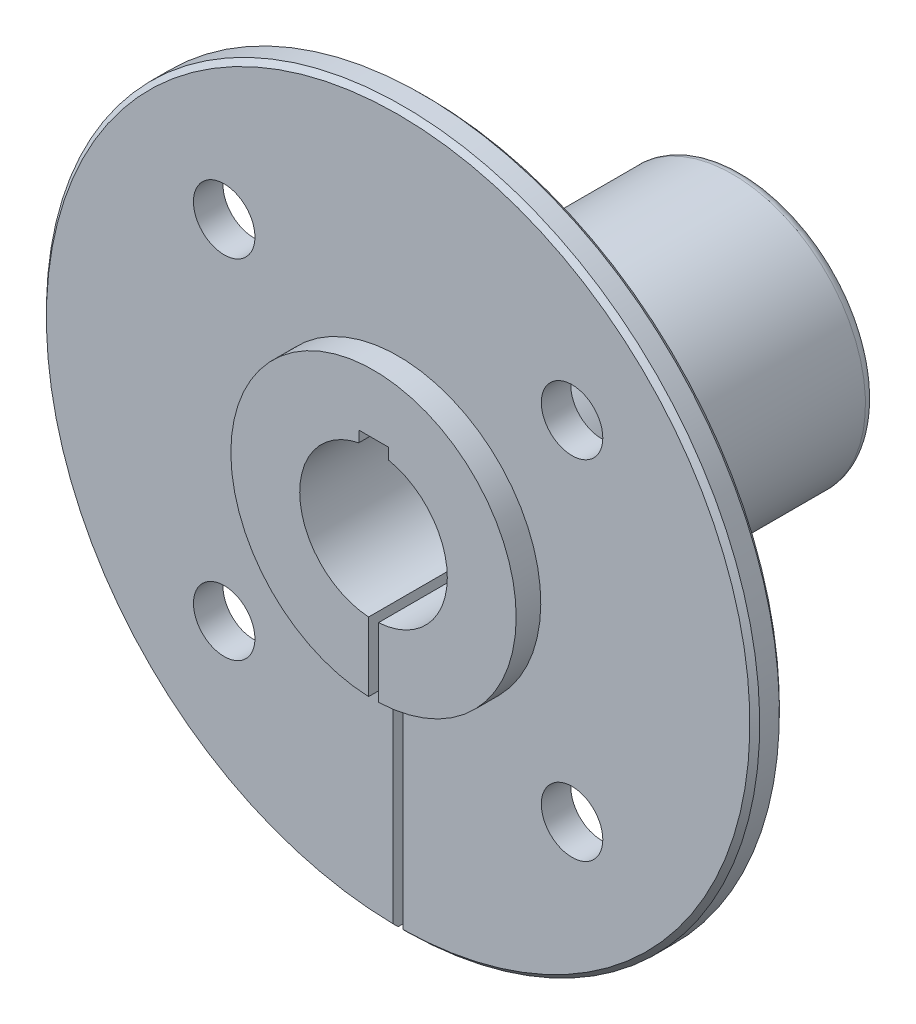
ISO-10303-21;
HEADER;
FILE_DESCRIPTION(('STEP AP214'),'2;1');
FILE_NAME('part.step','',(''),(''),'','','');
FILE_SCHEMA(('AUTOMOTIVE_DESIGN { 1 0 10303 214 1 1 1 1 }'));
ENDSEC;
DATA;
#1=APPLICATION_CONTEXT('core data for automotive mechanical design processes');
#2=APPLICATION_PROTOCOL_DEFINITION('international standard','automotive_design',2000,#1);
#3=PRODUCT_CONTEXT('',#1,'mechanical');
#4=PRODUCT('Part','Part','',(#3));
#5=PRODUCT_RELATED_PRODUCT_CATEGORY('part','',(#4));
#6=PRODUCT_DEFINITION_FORMATION('','',#4);
#7=PRODUCT_DEFINITION_CONTEXT('part definition',#1,'design');
#8=PRODUCT_DEFINITION('design','',#6,#7);
#9=PRODUCT_DEFINITION_SHAPE('','',#8);
#10=(LENGTH_UNIT() NAMED_UNIT(*) SI_UNIT(.MILLI.,.METRE.));
#11=(NAMED_UNIT(*) PLANE_ANGLE_UNIT() SI_UNIT($,.RADIAN.));
#12=(NAMED_UNIT(*) SI_UNIT($,.STERADIAN.) SOLID_ANGLE_UNIT());
#13=UNCERTAINTY_MEASURE_WITH_UNIT(LENGTH_MEASURE(1.E-05),#10,'distance_accuracy_value','');
#14=(GEOMETRIC_REPRESENTATION_CONTEXT(3) GLOBAL_UNCERTAINTY_ASSIGNED_CONTEXT((#13)) GLOBAL_UNIT_ASSIGNED_CONTEXT((#10,
#11,#12)) REPRESENTATION_CONTEXT('',''));
#15=CARTESIAN_POINT('',(0.,0.,0.));
#16=DIRECTION('',(0.,0.,1.));
#17=DIRECTION('',(1.,0.,0.));
#18=AXIS2_PLACEMENT_3D('',#15,#16,#17);
#19=CARTESIAN_POINT('',(0.,0.,0.));
#20=DIRECTION('',(0.,0.,1.));
#21=DIRECTION('',(1.,0.,0.));
#22=AXIS2_PLACEMENT_3D('',#19,#20,#21);
#23=PLANE('',#22);
#24=DIRECTION('',(0.,-1.,0.));
#25=VECTOR('',#24,1.);
#26=CARTESIAN_POINT('',(-1.,-72.5986978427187,0.));
#27=LINE('',#26,#25);
#28=CARTESIAN_POINT('',(-0.999999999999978,-14.9666295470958,0.));
#29=VERTEX_POINT('',#28);
#30=CARTESIAN_POINT('',(-0.999999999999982,-24.9799919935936,0.));
#31=VERTEX_POINT('',#30);
#32=EDGE_CURVE('E445',#29,#31,#27,.T.);
#33=ORIENTED_EDGE('',*,*,#32,.T.);
#34=CARTESIAN_POINT('',(0.,0.,0.));
#35=DIRECTION('',(0.,0.,1.));
#36=DIRECTION('',(1.,0.,0.));
#37=AXIS2_PLACEMENT_3D('',#34,#35,#36);
#38=CIRCLE('',#37,25.);
#39=CARTESIAN_POINT('',(1.,-24.9799919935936,0.));
#40=VERTEX_POINT('',#39);
#41=EDGE_CURVE('E327',#31,#40,#38,.F.);
#42=ORIENTED_EDGE('',*,*,#41,.T.);
#43=DIRECTION('',(0.,1.,0.));
#44=VECTOR('',#43,1.);
#45=CARTESIAN_POINT('',(1.,-71.4930066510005,0.));
#46=LINE('',#45,#44);
#47=CARTESIAN_POINT('',(1.,-14.9666295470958,0.));
#48=VERTEX_POINT('',#47);
#49=EDGE_CURVE('E441',#40,#48,#46,.T.);
#50=ORIENTED_EDGE('',*,*,#49,.T.);
#51=CARTESIAN_POINT('',(0.,0.,0.));
#52=DIRECTION('',(0.,0.,1.));
#53=DIRECTION('',(1.,0.,0.));
#54=AXIS2_PLACEMENT_3D('',#51,#52,#53);
#55=CIRCLE('',#54,15.);
#56=CARTESIAN_POINT('',(2.99999999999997,14.6969384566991,0.));
#57=VERTEX_POINT('',#56);
#58=EDGE_CURVE('E362',#48,#57,#55,.T.);
#59=ORIENTED_EDGE('',*,*,#58,.T.);
#60=DIRECTION('',(0.,-1.,0.));
#61=VECTOR('',#60,1.);
#62=CARTESIAN_POINT('',(3.00000000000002,-63.9414213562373,0.));
#63=LINE('',#62,#61);
#64=CARTESIAN_POINT('',(3.,16.9469384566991,0.));
#65=VERTEX_POINT('',#64);
#66=EDGE_CURVE('E379',#65,#57,#63,.T.);
#67=ORIENTED_EDGE('',*,*,#66,.F.);
#68=DIRECTION('',(1.,0.,0.));
#69=VECTOR('',#68,1.);
#70=CARTESIAN_POINT('',(0.,16.9469384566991,0.));
#71=LINE('',#70,#69);
#72=CARTESIAN_POINT('',(-3.,16.9469384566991,0.));
#73=VERTEX_POINT('',#72);
#74=EDGE_CURVE('E393',#73,#65,#71,.T.);
#75=ORIENTED_EDGE('',*,*,#74,.F.);
#76=DIRECTION('',(0.,-1.,0.));
#77=VECTOR('',#76,1.);
#78=CARTESIAN_POINT('',(-2.99999999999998,-63.9414213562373,0.));
#79=LINE('',#78,#77);
#80=CARTESIAN_POINT('',(-3.,14.6969384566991,0.));
#81=VERTEX_POINT('',#80);
#82=EDGE_CURVE('E390',#73,#81,#79,.T.);
#83=ORIENTED_EDGE('',*,*,#82,.T.);
#84=EDGE_CURVE('E358',#81,#29,#55,.T.);
#85=ORIENTED_EDGE('',*,*,#84,.T.);
#86=EDGE_LOOP('',(#33,#42,#50,#59,#67,#75,#83,#85));
#87=FACE_BOUND('',#86,.T.);
#88=ADVANCED_FACE('F33',(#87),#23,.F.);
#89=CARTESIAN_POINT('',(0.,0.,64.));
#90=DIRECTION('',(0.,0.,-1.));
#91=DIRECTION('',(-1.,0.,0.));
#92=AXIS2_PLACEMENT_3D('',#89,#90,#91);
#93=CYLINDRICAL_SURFACE('',#92,15.);
#94=CARTESIAN_POINT('',(0.,0.,75.));
#95=DIRECTION('',(0.,0.,1.));
#96=DIRECTION('',(1.,0.,0.));
#97=AXIS2_PLACEMENT_3D('',#94,#95,#96);
#98=CIRCLE('',#97,15.);
#99=CARTESIAN_POINT('',(-3.,14.6969384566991,75.));
#100=VERTEX_POINT('',#99);
#101=CARTESIAN_POINT('',(-1.00000000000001,-14.9666295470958,75.));
#102=VERTEX_POINT('',#101);
#103=EDGE_CURVE('E371',#100,#102,#98,.T.);
#104=ORIENTED_EDGE('',*,*,#103,.T.);
#105=DIRECTION('',(0.,0.,-1.));
#106=VECTOR('',#105,1.);
#107=CARTESIAN_POINT('',(-0.999999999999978,-14.9666295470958,64.));
#108=LINE('',#107,#106);
#109=EDGE_CURVE('E427',#102,#29,#108,.T.);
#110=ORIENTED_EDGE('',*,*,#109,.T.);
#111=ORIENTED_EDGE('',*,*,#84,.F.);
#112=DIRECTION('',(0.,0.,1.));
#113=VECTOR('',#112,1.);
#114=CARTESIAN_POINT('',(-3.,14.6969384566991,0.));
#115=LINE('',#114,#113);
#116=EDGE_CURVE('E378',#81,#100,#115,.T.);
#117=ORIENTED_EDGE('',*,*,#116,.T.);
#118=EDGE_LOOP('',(#104,#110,#111,#117));
#119=FACE_BOUND('',#118,.T.);
#120=ADVANCED_FACE('F195',(#119),#93,.F.);
#121=ORIENTED_EDGE('',*,*,#58,.F.);
#122=DIRECTION('',(0.,0.,-1.));
#123=VECTOR('',#122,1.);
#124=CARTESIAN_POINT('',(1.,-14.9666295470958,64.));
#125=LINE('',#124,#123);
#126=CARTESIAN_POINT('',(1.00000000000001,-14.9666295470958,75.));
#127=VERTEX_POINT('',#126);
#128=EDGE_CURVE('E302',#48,#127,#125,.F.);
#129=ORIENTED_EDGE('',*,*,#128,.T.);
#130=CARTESIAN_POINT('',(2.99999999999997,14.6969384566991,75.));
#131=VERTEX_POINT('',#130);
#132=EDGE_CURVE('E374',#127,#131,#98,.T.);
#133=ORIENTED_EDGE('',*,*,#132,.T.);
#134=DIRECTION('',(0.,0.,1.));
#135=VECTOR('',#134,1.);
#136=CARTESIAN_POINT('',(2.99999999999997,14.6969384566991,0.));
#137=LINE('',#136,#135);
#138=EDGE_CURVE('E382',#57,#131,#137,.T.);
#139=ORIENTED_EDGE('',*,*,#138,.F.);
#140=EDGE_LOOP('',(#121,#129,#133,#139));
#141=FACE_BOUND('',#140,.T.);
#142=ADVANCED_FACE('F200',(#141),#93,.F.);
#143=CARTESIAN_POINT('',(0.,0.,75.));
#144=DIRECTION('',(0.,0.,1.));
#145=DIRECTION('',(1.,0.,0.));
#146=AXIS2_PLACEMENT_3D('',#143,#144,#145);
#147=PLANE('',#146);
#148=CARTESIAN_POINT('',(0.,0.,75.));
#149=DIRECTION('',(0.,0.,1.));
#150=DIRECTION('',(1.,0.,0.));
#151=AXIS2_PLACEMENT_3D('',#148,#149,#150);
#152=CIRCLE('',#151,29.);
#153=CARTESIAN_POINT('',(1.00000000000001,-28.9827534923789,75.));
#154=VERTEX_POINT('',#153);
#155=CARTESIAN_POINT('',(-1.00000000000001,-28.9827534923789,75.));
#156=VERTEX_POINT('',#155);
#157=EDGE_CURVE('E365',#154,#156,#152,.T.);
#158=ORIENTED_EDGE('',*,*,#157,.T.);
#159=DIRECTION('',(0.,-1.,0.));
#160=VECTOR('',#159,1.);
#161=CARTESIAN_POINT('',(-1.00000000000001,-14.6176835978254,75.));
#162=LINE('',#161,#160);
#163=EDGE_CURVE('E350',#102,#156,#162,.T.);
#164=ORIENTED_EDGE('',*,*,#163,.F.);
#165=ORIENTED_EDGE('',*,*,#103,.F.);
#166=DIRECTION('',(0.,-1.,0.));
#167=VECTOR('',#166,1.);
#168=CARTESIAN_POINT('',(-2.99999999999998,-63.9414213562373,75.));
#169=LINE('',#168,#167);
#170=CARTESIAN_POINT('',(-3.,16.9469384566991,75.));
#171=VERTEX_POINT('',#170);
#172=EDGE_CURVE('E398',#171,#100,#169,.T.);
#173=ORIENTED_EDGE('',*,*,#172,.F.);
#174=DIRECTION('',(1.,0.,0.));
#175=VECTOR('',#174,1.);
#176=CARTESIAN_POINT('',(0.,16.9469384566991,75.));
#177=LINE('',#176,#175);
#178=CARTESIAN_POINT('',(3.,16.9469384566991,75.));
#179=VERTEX_POINT('',#178);
#180=EDGE_CURVE('E400',#171,#179,#177,.T.);
#181=ORIENTED_EDGE('',*,*,#180,.T.);
#182=DIRECTION('',(0.,-1.,0.));
#183=VECTOR('',#182,1.);
#184=CARTESIAN_POINT('',(3.00000000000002,-63.9414213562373,75.));
#185=LINE('',#184,#183);
#186=EDGE_CURVE('E395',#179,#131,#185,.T.);
#187=ORIENTED_EDGE('',*,*,#186,.T.);
#188=ORIENTED_EDGE('',*,*,#132,.F.);
#189=DIRECTION('',(0.,1.,0.));
#190=VECTOR('',#189,1.);
#191=CARTESIAN_POINT('',(1.,-71.4930066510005,75.));
#192=LINE('',#191,#190);
#193=EDGE_CURVE('E438',#154,#127,#192,.T.);
#194=ORIENTED_EDGE('',*,*,#193,.F.);
#195=EDGE_LOOP('',(#158,#164,#165,#173,#181,#187,#188,#194));
#196=FACE_BOUND('',#195,.T.);
#197=ADVANCED_FACE('F214',(#196),#147,.T.);
#198=CARTESIAN_POINT('',(0.,0.,70.));
#199=DIRECTION('',(0.,0.,1.));
#200=DIRECTION('',(1.,0.,0.));
#201=AXIS2_PLACEMENT_3D('',#198,#199,#200);
#202=PLANE('',#201);
#203=CARTESIAN_POINT('',(-35.3553390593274,-35.3553390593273,70.));
#204=DIRECTION('',(0.,0.,1.));
#205=DIRECTION('',(1.,0.,0.));
#206=AXIS2_PLACEMENT_3D('',#203,#204,#205);
#207=CIRCLE('',#206,6.24999999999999);
#208=CARTESIAN_POINT('',(-29.1053390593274,-35.3553390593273,70.));
#209=VERTEX_POINT('',#208);
#210=EDGE_CURVE('E406',#209,#209,#207,.T.);
#211=ORIENTED_EDGE('',*,*,#210,.F.);
#212=EDGE_LOOP('',(#211));
#213=FACE_BOUND('',#212,.T.);
#214=CARTESIAN_POINT('',(35.3553390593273,-35.3553390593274,70.));
#215=DIRECTION('',(0.,0.,1.));
#216=DIRECTION('',(1.,0.,0.));
#217=AXIS2_PLACEMENT_3D('',#214,#215,#216);
#218=CIRCLE('',#217,6.24999999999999);
#219=CARTESIAN_POINT('',(41.6053390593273,-35.3553390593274,70.));
#220=VERTEX_POINT('',#219);
#221=EDGE_CURVE('E412',#220,#220,#218,.T.);
#222=ORIENTED_EDGE('',*,*,#221,.F.);
#223=EDGE_LOOP('',(#222));
#224=FACE_BOUND('',#223,.T.);
#225=CARTESIAN_POINT('',(35.3553390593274,35.3553390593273,70.));
#226=DIRECTION('',(0.,0.,1.));
#227=DIRECTION('',(1.,0.,0.));
#228=AXIS2_PLACEMENT_3D('',#225,#226,#227);
#229=CIRCLE('',#228,6.24999999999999);
#230=CARTESIAN_POINT('',(41.6053390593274,35.3553390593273,70.));
#231=VERTEX_POINT('',#230);
#232=EDGE_CURVE('E418',#231,#231,#229,.T.);
#233=ORIENTED_EDGE('',*,*,#232,.F.);
#234=EDGE_LOOP('',(#233));
#235=FACE_BOUND('',#234,.T.);
#236=CARTESIAN_POINT('',(-35.3553390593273,35.3553390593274,70.));
#237=DIRECTION('',(0.,0.,1.));
#238=DIRECTION('',(1.,0.,0.));
#239=AXIS2_PLACEMENT_3D('',#236,#237,#238);
#240=CIRCLE('',#239,6.24999999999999);
#241=CARTESIAN_POINT('',(-29.1053390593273,35.3553390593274,70.));
#242=VERTEX_POINT('',#241);
#243=EDGE_CURVE('E424',#242,#242,#240,.T.);
#244=ORIENTED_EDGE('',*,*,#243,.F.);
#245=EDGE_LOOP('',(#244));
#246=FACE_BOUND('',#245,.T.);
#247=CARTESIAN_POINT('',(0.,0.,70.));
#248=DIRECTION('',(0.,0.,1.));
#249=DIRECTION('',(1.,0.,0.));
#250=AXIS2_PLACEMENT_3D('',#247,#248,#249);
#251=CIRCLE('',#250,71.5);
#252=CARTESIAN_POINT('',(1.,-71.4930066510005,70.));
#253=VERTEX_POINT('',#252);
#254=CARTESIAN_POINT('',(-1.,-71.4930066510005,70.));
#255=VERTEX_POINT('',#254);
#256=EDGE_CURVE('E325',#253,#255,#251,.T.);
#257=ORIENTED_EDGE('',*,*,#256,.T.);
#258=DIRECTION('',(0.,1.,0.));
#259=VECTOR('',#258,1.);
#260=CARTESIAN_POINT('',(-0.999999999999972,0.,70.));
#261=LINE('',#260,#259);
#262=CARTESIAN_POINT('',(-0.999999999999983,-28.9827534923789,70.));
#263=VERTEX_POINT('',#262);
#264=EDGE_CURVE('E277',#255,#263,#261,.T.);
#265=ORIENTED_EDGE('',*,*,#264,.T.);
#266=CARTESIAN_POINT('',(0.,0.,70.));
#267=DIRECTION('',(0.,0.,1.));
#268=DIRECTION('',(1.,0.,0.));
#269=AXIS2_PLACEMENT_3D('',#266,#267,#268);
#270=CIRCLE('',#269,29.);
#271=CARTESIAN_POINT('',(1.,-28.9827534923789,70.));
#272=VERTEX_POINT('',#271);
#273=EDGE_CURVE('E368',#272,#263,#270,.T.);
#274=ORIENTED_EDGE('',*,*,#273,.F.);
#275=DIRECTION('',(0.,-1.,0.));
#276=VECTOR('',#275,1.);
#277=CARTESIAN_POINT('',(1.,0.,70.));
#278=LINE('',#277,#276);
#279=EDGE_CURVE('E296',#272,#253,#278,.T.);
#280=ORIENTED_EDGE('',*,*,#279,.T.);
#281=EDGE_LOOP('',(#257,#265,#274,#280));
#282=FACE_BOUND('',#281,.T.);
#283=ADVANCED_FACE('F211',(#213,#224,#235,#246,#282),#202,.T.);
#284=CARTESIAN_POINT('',(0.,0.,64.));
#285=DIRECTION('',(0.,0.,-1.));
#286=DIRECTION('',(-1.,0.,0.));
#287=AXIS2_PLACEMENT_3D('',#284,#285,#286);
#288=CYLINDRICAL_SURFACE('',#287,27.);
#289=DIRECTION('',(0.,0.,-1.));
#290=VECTOR('',#289,1.);
#291=CARTESIAN_POINT('',(-7.5,-25.9374246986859,64.));
#292=LINE('',#291,#290);
#293=CARTESIAN_POINT('',(-7.5,-25.9374246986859,39.337758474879));
#294=VERTEX_POINT('',#293);
#295=CARTESIAN_POINT('',(-7.5,-25.9374246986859,40.662241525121));
#296=VERTEX_POINT('',#295);
#297=EDGE_CURVE('E171',#294,#296,#292,.F.);
#298=ORIENTED_EDGE('',*,*,#297,.F.);
#299=CARTESIAN_POINT('',(-7.50000000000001,-25.9374246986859,40.662241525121));
#300=CARTESIAN_POINT('',(-7.54170910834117,-25.9253723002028,40.752161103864));
#301=CARTESIAN_POINT('',(-7.58967718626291,-25.9113865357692,40.8384607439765));
#302=CARTESIAN_POINT('',(-7.69480095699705,-25.8803572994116,41.0040418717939));
#303=CARTESIAN_POINT('',(-7.7519025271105,-25.8633317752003,41.0833606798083));
#304=CARTESIAN_POINT('',(-7.87153091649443,-25.8271734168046,41.2349743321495));
#305=CARTESIAN_POINT('',(-7.93395466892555,-25.8080792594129,41.3073622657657));
#306=CARTESIAN_POINT('',(-8.0634300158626,-25.7679198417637,41.4475046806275));
#307=CARTESIAN_POINT('',(-8.13048959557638,-25.7468511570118,41.5152507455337));
#308=CARTESIAN_POINT('',(-8.28677835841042,-25.6970377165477,41.664712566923));
#309=CARTESIAN_POINT('',(-8.37704329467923,-25.6677725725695,41.7451633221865));
#310=CARTESIAN_POINT('',(-8.56136847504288,-25.6068820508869,41.9006783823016));
#311=CARTESIAN_POINT('',(-8.65543049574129,-25.5752555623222,41.9757401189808));
#312=CARTESIAN_POINT('',(-8.84634446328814,-25.5098486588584,42.1213694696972));
#313=CARTESIAN_POINT('',(-8.94319837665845,-25.4760667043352,42.1919337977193));
#314=CARTESIAN_POINT('',(-9.13893949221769,-25.4065068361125,42.3291634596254));
#315=CARTESIAN_POINT('',(-9.23782702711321,-25.3707285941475,42.3958281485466));
#316=CARTESIAN_POINT('',(-9.54040833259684,-25.2592024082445,42.5931090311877));
#317=CARTESIAN_POINT('',(-9.74649145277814,-25.1804650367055,42.7183877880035));
#318=CARTESIAN_POINT('',(-10.1620826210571,-25.0156371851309,42.9574565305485));
#319=CARTESIAN_POINT('',(-10.3715886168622,-24.9295509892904,43.0712531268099));
#320=CARTESIAN_POINT('',(-10.7769585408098,-24.7568580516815,43.2807777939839));
#321=CARTESIAN_POINT('',(-10.9726747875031,-24.6707688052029,43.3772204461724));
#322=CARTESIAN_POINT('',(-11.3650779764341,-24.4924776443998,43.5622128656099));
#323=CARTESIAN_POINT('',(-11.5617650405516,-24.400274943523,43.6507616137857));
#324=CARTESIAN_POINT('',(-11.9556306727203,-24.2097250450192,43.8202978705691));
#325=CARTESIAN_POINT('',(-12.1528094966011,-24.1113733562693,43.9012797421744));
#326=CARTESIAN_POINT('',(-12.5470309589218,-23.9086004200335,44.0556333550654));
#327=CARTESIAN_POINT('',(-12.7440735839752,-23.8041786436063,44.1290044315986));
#328=CARTESIAN_POINT('',(-13.3310667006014,-23.4836159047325,44.3363337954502));
#329=CARTESIAN_POINT('',(-13.7202569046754,-23.2585511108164,44.4589565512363));
#330=CARTESIAN_POINT('',(-14.4931488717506,-22.7849471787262,44.6706178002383));
#331=CARTESIAN_POINT('',(-14.8768547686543,-22.5364269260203,44.7596830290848));
#332=CARTESIAN_POINT('',(-15.4943084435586,-22.1135642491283,44.8730695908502));
#333=CARTESIAN_POINT('',(-15.7306433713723,-21.9460993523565,44.9091493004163));
#334=CARTESIAN_POINT('',(-16.1991161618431,-21.6026142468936,44.9643179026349));
#335=CARTESIAN_POINT('',(-16.4312539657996,-21.4265939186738,44.9834065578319));
#336=CARTESIAN_POINT('',(-16.8902553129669,-21.0666645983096,45.0025221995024));
#337=CARTESIAN_POINT('',(-17.1171178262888,-20.8827540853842,45.0025454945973));
#338=CARTESIAN_POINT('',(-17.5641550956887,-20.5081786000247,44.9810808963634));
#339=CARTESIAN_POINT('',(-17.7843319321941,-20.3175157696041,44.9595997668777));
#340=CARTESIAN_POINT('',(-18.1583388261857,-19.9829858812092,44.9013862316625));
#341=CARTESIAN_POINT('',(-18.3141100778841,-19.8402993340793,44.8702973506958));
#342=CARTESIAN_POINT('',(-18.6204406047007,-19.5530880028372,44.7939329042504));
#343=CARTESIAN_POINT('',(-18.7709999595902,-19.4085632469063,44.7486575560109));
#344=CARTESIAN_POINT('',(-19.0658052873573,-19.1190394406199,44.6427420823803));
#345=CARTESIAN_POINT('',(-19.210059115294,-18.9740412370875,44.5821217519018));
#346=CARTESIAN_POINT('',(-19.4913244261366,-18.684993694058,44.4443012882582));
#347=CARTESIAN_POINT('',(-19.6283379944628,-18.5409440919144,44.3671059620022));
#348=CARTESIAN_POINT('',(-19.9615068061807,-18.183077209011,44.1511543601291));
#349=CARTESIAN_POINT('',(-20.1523732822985,-17.9709675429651,44.0010410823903));
#350=CARTESIAN_POINT('',(-20.5098296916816,-17.5619080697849,43.6575580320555));
#351=CARTESIAN_POINT('',(-20.676448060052,-17.3649406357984,43.4642396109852));
#352=CARTESIAN_POINT('',(-20.9534152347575,-17.0291889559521,43.0714660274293));
#353=CARTESIAN_POINT('',(-21.0685091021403,-16.886251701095,42.8789839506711));
#354=CARTESIAN_POINT('',(-21.2233695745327,-16.6905827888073,42.5696683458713));
#355=CARTESIAN_POINT('',(-21.2720431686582,-16.6284603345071,42.4630816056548));
#356=CARTESIAN_POINT('',(-21.3630779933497,-16.5113411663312,42.2435144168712));
#357=CARTESIAN_POINT('',(-21.4054419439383,-16.4563413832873,42.1305367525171));
#358=CARTESIAN_POINT('',(-21.4837576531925,-16.3539703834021,41.8980125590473));
#359=CARTESIAN_POINT('',(-21.5196632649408,-16.3066542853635,41.7784261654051));
#360=CARTESIAN_POINT('',(-21.5843452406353,-16.220940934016,41.5342880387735));
#361=CARTESIAN_POINT('',(-21.61312496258,-16.182539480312,41.4097386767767));
#362=CARTESIAN_POINT('',(-21.6632816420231,-16.1153340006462,41.1566383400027));
#363=CARTESIAN_POINT('',(-21.6846597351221,-16.0865285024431,41.0280879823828));
#364=CARTESIAN_POINT('',(-21.7197932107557,-16.0390604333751,40.7681086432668));
#365=CARTESIAN_POINT('',(-21.7335494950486,-16.020396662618,40.6366800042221));
#366=CARTESIAN_POINT('',(-21.7521891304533,-15.9950767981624,40.3870022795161));
#367=CARTESIAN_POINT('',(-21.757893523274,-15.9873101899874,40.2689252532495));
#368=CARTESIAN_POINT('',(-21.7631306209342,-15.9801804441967,40.0323835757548));
#369=CARTESIAN_POINT('',(-21.7626637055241,-15.9808167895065,39.9139189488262));
#370=CARTESIAN_POINT('',(-21.7555632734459,-15.9904815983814,39.6775556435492));
#371=CARTESIAN_POINT('',(-21.7489316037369,-15.9995075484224,39.5596568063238));
#372=CARTESIAN_POINT('',(-21.7295620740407,-16.0258041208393,39.3252919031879));
#373=CARTESIAN_POINT('',(-21.716824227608,-16.0430747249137,39.2088258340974));
#374=CARTESIAN_POINT('',(-21.6859723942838,-16.0847519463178,38.9827588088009));
#375=CARTESIAN_POINT('',(-21.6680916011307,-16.1088484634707,38.8730687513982));
#376=CARTESIAN_POINT('',(-21.6269363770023,-16.164058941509,38.6564920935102));
#377=CARTESIAN_POINT('',(-21.6036602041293,-16.1951751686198,38.5496064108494));
#378=CARTESIAN_POINT('',(-21.525990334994,-16.2984418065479,38.2342122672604));
#379=CARTESIAN_POINT('',(-21.4637276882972,-16.3805480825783,38.0307659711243));
#380=CARTESIAN_POINT('',(-21.3162702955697,-16.5720208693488,37.6318195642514));
#381=CARTESIAN_POINT('',(-21.2300507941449,-16.6825836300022,37.4372839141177));
#382=CARTESIAN_POINT('',(-21.0386977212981,-16.9232625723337,37.0710121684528));
#383=CARTESIAN_POINT('',(-20.933557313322,-17.0533858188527,36.8992843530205));
#384=CARTESIAN_POINT('',(-20.6918048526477,-17.3461746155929,36.558856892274));
#385=CARTESIAN_POINT('',(-20.5528690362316,-17.5108677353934,36.393568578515));
#386=CARTESIAN_POINT('',(-20.2572746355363,-17.8519965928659,36.09385091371));
#387=CARTESIAN_POINT('',(-20.1006035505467,-18.0284405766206,35.9594435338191));
#388=CARTESIAN_POINT('',(-19.8083515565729,-18.3484479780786,35.7460946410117));
#389=CARTESIAN_POINT('',(-19.6755711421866,-18.4908383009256,35.6614461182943));
#390=CARTESIAN_POINT('',(-19.40230294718,-18.7773754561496,35.5090890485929));
#391=CARTESIAN_POINT('',(-19.2618118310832,-18.9215230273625,35.4413879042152));
#392=CARTESIAN_POINT('',(-18.9740723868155,-19.2100538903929,35.321698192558));
#393=CARTESIAN_POINT('',(-18.8268131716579,-19.3544371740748,35.2697360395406));
#394=CARTESIAN_POINT('',(-18.5267339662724,-19.6418769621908,35.1804435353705));
#395=CARTESIAN_POINT('',(-18.3739139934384,-19.7849334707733,35.1431131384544));
#396=CARTESIAN_POINT('',(-17.9941799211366,-20.1321116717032,35.0681951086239));
#397=CARTESIAN_POINT('',(-17.7646537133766,-20.3349742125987,35.0379372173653));
#398=CARTESIAN_POINT('',(-17.2976839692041,-20.7336570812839,35.0021333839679));
#399=CARTESIAN_POINT('',(-17.0602369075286,-20.9294741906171,34.9965985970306));
#400=CARTESIAN_POINT('',(-16.5785901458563,-21.3130318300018,35.0073097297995));
#401=CARTESIAN_POINT('',(-16.3343767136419,-21.5007536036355,35.0236036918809));
#402=CARTESIAN_POINT('',(-15.8410779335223,-21.8667471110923,35.0755257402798));
#403=CARTESIAN_POINT('',(-15.5919928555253,-22.0450193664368,35.1111527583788));
#404=CARTESIAN_POINT('',(-14.9783048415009,-22.4687452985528,35.2193222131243));
#405=CARTESIAN_POINT('',(-14.6116111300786,-22.7088013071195,35.3012364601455));
#406=CARTESIAN_POINT('',(-13.8729256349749,-23.1674579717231,35.4962631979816));
#407=CARTESIAN_POINT('',(-13.500930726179,-23.3860453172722,35.6093948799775));
#408=CARTESIAN_POINT('',(-12.9414967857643,-23.6973238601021,35.8001303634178));
#409=CARTESIAN_POINT('',(-12.7549264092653,-23.7982431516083,35.8671539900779));
#410=CARTESIAN_POINT('',(-12.3815187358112,-23.9946341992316,36.0080721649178));
#411=CARTESIAN_POINT('',(-12.1946814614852,-24.0901063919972,36.081966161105));
#412=CARTESIAN_POINT('',(-11.821228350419,-24.2755433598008,36.2365340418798));
#413=CARTESIAN_POINT('',(-11.6346124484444,-24.3655111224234,36.3172041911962));
#414=CARTESIAN_POINT('',(-11.2619763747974,-24.5399713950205,36.4854875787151));
#415=CARTESIAN_POINT('',(-11.0759561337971,-24.6244645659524,36.5730999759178));
#416=CARTESIAN_POINT('',(-10.7351101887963,-24.77471012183,36.7408727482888));
#417=CARTESIAN_POINT('',(-10.5801090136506,-24.8412822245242,36.8199438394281));
#418=CARTESIAN_POINT('',(-10.2714036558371,-24.9705077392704,36.9836285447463));
#419=CARTESIAN_POINT('',(-10.117699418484,-25.0331613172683,37.0682419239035));
#420=CARTESIAN_POINT('',(-9.8119313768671,-25.1545843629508,37.243811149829));
#421=CARTESIAN_POINT('',(-9.65987141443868,-25.2133459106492,37.3347791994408));
#422=CARTESIAN_POINT('',(-9.35866219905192,-25.3266914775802,37.5238614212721));
#423=CARTESIAN_POINT('',(-9.20951244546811,-25.3812762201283,37.621974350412));
#424=CARTESIAN_POINT('',(-8.96674383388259,-25.4677811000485,37.7912276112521));
#425=CARTESIAN_POINT('',(-8.87184978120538,-25.5009822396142,37.8598837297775));
#426=CARTESIAN_POINT('',(-8.684608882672,-25.5653546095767,38.0014748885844));
#427=CARTESIAN_POINT('',(-8.59226151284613,-25.5965262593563,38.0744090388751));
#428=CARTESIAN_POINT('',(-8.41165174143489,-25.6564437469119,38.224843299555));
#429=CARTESIAN_POINT('',(-8.32336584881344,-25.6852046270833,38.3023090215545));
#430=CARTESIAN_POINT('',(-8.15160170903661,-25.7402311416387,38.4632871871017));
#431=CARTESIAN_POINT('',(-8.06812251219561,-25.7664972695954,38.5467984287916));
#432=CARTESIAN_POINT('',(-7.94035847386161,-25.806069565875,38.6861437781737));
#433=CARTESIAN_POINT('',(-7.89380231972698,-25.820342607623,38.7396164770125));
#434=CARTESIAN_POINT('',(-7.80397015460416,-25.8476352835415,38.8494835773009));
#435=CARTESIAN_POINT('',(-7.76069102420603,-25.86065611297,38.9058751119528));
#436=CARTESIAN_POINT('',(-7.67781833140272,-25.8853816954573,39.0226040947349));
#437=CARTESIAN_POINT('',(-7.63827088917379,-25.8970702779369,39.0829783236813));
#438=CARTESIAN_POINT('',(-7.56464171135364,-25.9186749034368,39.2075094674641));
#439=CARTESIAN_POINT('',(-7.53057739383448,-25.9285853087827,39.2716775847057));
#440=CARTESIAN_POINT('',(-7.5,-25.9374246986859,39.337758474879));
#441=B_SPLINE_CURVE_WITH_KNOTS('',3,(#299,#300,#301,#302,#303,#304,#305,#306,#307,#308,#309,
#310,#311,#312,#313,#314,#315,#316,#317,#318,#319,#320,#321,#322,#323,#324,#325,#326,#327,#328,
#329,#330,#331,#332,#333,#334,#335,#336,#337,#338,#339,#340,#341,#342,#343,#344,#345,#346,#347,
#348,#349,#350,#351,#352,#353,#354,#355,#356,#357,#358,#359,#360,#361,#362,#363,#364,#365,#366,
#367,#368,#369,#370,#371,#372,#373,#374,#375,#376,#377,#378,#379,#380,#381,#382,#383,#384,#385,
#386,#387,#388,#389,#390,#391,#392,#393,#394,#395,#396,#397,#398,#399,#400,#401,#402,#403,#404,
#405,#406,#407,#408,#409,#410,#411,#412,#413,#414,#415,#416,#417,#418,#419,#420,#421,#422,#423,
#424,#425,#426,#427,#428,#429,#430,#431,#432,#433,#434,#435,#436,#437,#438,#439,#440),
.UNSPECIFIED.,.F.,.F.,(4,2,2,2,2,2,2,2,2,2,2,2,2,2,2,2,2,2,2,2,2,2,2,2,2,2,2,2,2,2,2,2,2,2,2,2,
2,2,2,2,2,2,2,2,2,2,2,2,2,2,2,2,2,2,2,2,2,2,2,2,2,2,2,2,2,2,2,2,2,2,4),(0.,0.298687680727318,
0.595666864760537,0.887827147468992,1.1805038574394,1.55345725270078,1.92658721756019,
2.29998675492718,2.67344787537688,3.4340172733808,4.19414626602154,4.89759357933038,
5.60113157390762,6.3051895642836,7.00930899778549,8.40553655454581,9.80064935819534,
10.6757681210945,11.5508991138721,12.4261995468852,13.3012247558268,13.9413078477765,
14.5813811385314,15.2206329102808,15.8596995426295,16.8232081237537,17.7855775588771,
18.5798092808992,18.9772615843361,19.3745420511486,19.7745572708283,20.1743836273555,
20.5741486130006,20.973866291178,21.3288271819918,21.6837662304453,22.0385989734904,
22.393430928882,22.7341935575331,23.0750663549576,23.756200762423,24.4727808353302,
25.1896203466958,26.0013702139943,26.8136958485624,27.4497541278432,28.0860897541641,
28.723487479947,29.3608832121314,30.2829209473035,31.2053746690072,32.1298619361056,
33.0542981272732,34.3900178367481,35.7265605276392,36.3937791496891,37.0609442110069,
37.7277438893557,38.3944629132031,38.9532623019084,39.5120380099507,40.0719179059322,
40.6317006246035,40.9968306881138,41.3618850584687,41.7244592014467,42.0869614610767,
42.303812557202,42.5204545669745,42.7394956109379,42.9592192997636),.UNSPECIFIED.);
#442=EDGE_CURVE('E51',#296,#294,#441,.T.);
#443=ORIENTED_EDGE('',*,*,#442,.F.);
#444=EDGE_LOOP('',(#298,#443));
#445=FACE_BOUND('',#444,.T.);
#446=DIRECTION('',(0.,0.,-1.));
#447=VECTOR('',#446,1.);
#448=CARTESIAN_POINT('',(-7.5,-25.9374246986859,64.));
#449=LINE('',#448,#447);
#450=CARTESIAN_POINT('',(-7.5,-25.9374246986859,14.337758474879));
#451=VERTEX_POINT('',#450);
#452=CARTESIAN_POINT('',(-7.5,-25.9374246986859,15.662241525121));
#453=VERTEX_POINT('',#452);
#454=EDGE_CURVE('E780',#451,#453,#449,.F.);
#455=ORIENTED_EDGE('',*,*,#454,.F.);
#456=CARTESIAN_POINT('',(-7.50000000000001,-25.9374246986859,15.6622415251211));
#457=CARTESIAN_POINT('',(-7.54170910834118,-25.9253723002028,15.7521611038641));
#458=CARTESIAN_POINT('',(-7.58967718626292,-25.9113865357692,15.8384607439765));
#459=CARTESIAN_POINT('',(-7.69480095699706,-25.8803572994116,16.004041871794));
#460=CARTESIAN_POINT('',(-7.75190252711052,-25.8633317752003,16.0833606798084));
#461=CARTESIAN_POINT('',(-7.87153091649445,-25.8271734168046,16.2349743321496));
#462=CARTESIAN_POINT('',(-7.93395466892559,-25.8080792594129,16.3073622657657));
#463=CARTESIAN_POINT('',(-8.06343001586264,-25.7679198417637,16.4475046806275));
#464=CARTESIAN_POINT('',(-8.13048959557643,-25.7468511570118,16.5152507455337));
#465=CARTESIAN_POINT('',(-8.28677835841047,-25.6970377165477,16.664712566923));
#466=CARTESIAN_POINT('',(-8.37704329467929,-25.6677725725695,16.7451633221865));
#467=CARTESIAN_POINT('',(-8.56136847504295,-25.6068820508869,16.9006783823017));
#468=CARTESIAN_POINT('',(-8.65543049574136,-25.5752555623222,16.9757401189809));
#469=CARTESIAN_POINT('',(-8.84634446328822,-25.5098486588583,17.1213694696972));
#470=CARTESIAN_POINT('',(-8.94319837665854,-25.4760667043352,17.1919337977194));
#471=CARTESIAN_POINT('',(-9.1389394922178,-25.4065068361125,17.3291634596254));
#472=CARTESIAN_POINT('',(-9.23782702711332,-25.3707285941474,17.3958281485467));
#473=CARTESIAN_POINT('',(-9.54040833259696,-25.2592024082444,17.5931090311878));
#474=CARTESIAN_POINT('',(-9.74649145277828,-25.1804650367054,17.7183877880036));
#475=CARTESIAN_POINT('',(-10.1620826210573,-25.0156371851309,17.9574565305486));
#476=CARTESIAN_POINT('',(-10.3715886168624,-24.9295509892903,18.07125312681));
#477=CARTESIAN_POINT('',(-10.77695854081,-24.7568580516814,18.280777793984));
#478=CARTESIAN_POINT('',(-10.9726747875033,-24.6707688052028,18.3772204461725));
#479=CARTESIAN_POINT('',(-11.3650779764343,-24.4924776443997,18.56221286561));
#480=CARTESIAN_POINT('',(-11.5617650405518,-24.4002749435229,18.6507616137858));
#481=CARTESIAN_POINT('',(-11.9556306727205,-24.2097250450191,18.8202978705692));
#482=CARTESIAN_POINT('',(-12.1528094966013,-24.1113733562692,18.9012797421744));
#483=CARTESIAN_POINT('',(-12.547030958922,-23.9086004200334,19.0556333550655));
#484=CARTESIAN_POINT('',(-12.7440735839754,-23.8041786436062,19.1290044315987));
#485=CARTESIAN_POINT('',(-13.3310667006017,-23.4836159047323,19.3363337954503));
#486=CARTESIAN_POINT('',(-13.7202569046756,-23.2585511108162,19.4589565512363));
#487=CARTESIAN_POINT('',(-14.4931488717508,-22.7849471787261,19.6706178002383));
#488=CARTESIAN_POINT('',(-14.8768547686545,-22.5364269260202,19.7596830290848));
#489=CARTESIAN_POINT('',(-15.4943084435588,-22.1135642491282,19.8730695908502));
#490=CARTESIAN_POINT('',(-15.7306433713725,-21.9460993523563,19.9091493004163));
#491=CARTESIAN_POINT('',(-16.1991161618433,-21.6026142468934,19.9643179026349));
#492=CARTESIAN_POINT('',(-16.4312539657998,-21.4265939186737,19.9834065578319));
#493=CARTESIAN_POINT('',(-16.890255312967,-21.0666645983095,20.0025221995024));
#494=CARTESIAN_POINT('',(-17.117117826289,-20.8827540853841,20.0025454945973));
#495=CARTESIAN_POINT('',(-17.5641550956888,-20.5081786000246,19.9810808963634));
#496=CARTESIAN_POINT('',(-17.7843319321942,-20.317515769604,19.9595997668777));
#497=CARTESIAN_POINT('',(-18.1583388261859,-19.9829858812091,19.9013862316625));
#498=CARTESIAN_POINT('',(-18.3141100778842,-19.8402993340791,19.8702973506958));
#499=CARTESIAN_POINT('',(-18.6204406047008,-19.5530880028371,19.7939329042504));
#500=CARTESIAN_POINT('',(-18.7709999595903,-19.4085632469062,19.7486575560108));
#501=CARTESIAN_POINT('',(-19.0658052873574,-19.1190394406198,19.6427420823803));
#502=CARTESIAN_POINT('',(-19.2100591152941,-18.9740412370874,19.5821217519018));
#503=CARTESIAN_POINT('',(-19.4913244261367,-18.684993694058,19.4443012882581));
#504=CARTESIAN_POINT('',(-19.6283379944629,-18.5409440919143,19.3671059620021));
#505=CARTESIAN_POINT('',(-19.9615068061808,-18.1830772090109,19.151154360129));
#506=CARTESIAN_POINT('',(-20.1523732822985,-17.970967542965,19.0010410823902));
#507=CARTESIAN_POINT('',(-20.5098296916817,-17.5619080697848,18.6575580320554));
#508=CARTESIAN_POINT('',(-20.676448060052,-17.3649406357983,18.4642396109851));
#509=CARTESIAN_POINT('',(-20.9534152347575,-17.029188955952,18.0714660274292));
#510=CARTESIAN_POINT('',(-21.0685091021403,-16.8862517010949,17.878983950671));
#511=CARTESIAN_POINT('',(-21.2233695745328,-16.6905827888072,17.5696683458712));
#512=CARTESIAN_POINT('',(-21.2720431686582,-16.6284603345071,17.4630816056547));
#513=CARTESIAN_POINT('',(-21.3630779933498,-16.5113411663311,17.2435144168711));
#514=CARTESIAN_POINT('',(-21.4054419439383,-16.4563413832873,17.130536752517));
#515=CARTESIAN_POINT('',(-21.4837576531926,-16.3539703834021,16.8980125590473));
#516=CARTESIAN_POINT('',(-21.5196632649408,-16.3066542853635,16.778426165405));
#517=CARTESIAN_POINT('',(-21.5843452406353,-16.220940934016,16.5342880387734));
#518=CARTESIAN_POINT('',(-21.61312496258,-16.182539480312,16.4097386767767));
#519=CARTESIAN_POINT('',(-21.6632816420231,-16.1153340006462,16.1566383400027));
#520=CARTESIAN_POINT('',(-21.6846597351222,-16.086528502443,16.0280879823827));
#521=CARTESIAN_POINT('',(-21.7197932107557,-16.0390604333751,15.7681086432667));
#522=CARTESIAN_POINT('',(-21.7335494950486,-16.020396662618,15.6366800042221));
#523=CARTESIAN_POINT('',(-21.7521891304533,-15.9950767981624,15.3870022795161));
#524=CARTESIAN_POINT('',(-21.757893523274,-15.9873101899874,15.2689252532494));
#525=CARTESIAN_POINT('',(-21.7631306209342,-15.9801804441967,15.0323835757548));
#526=CARTESIAN_POINT('',(-21.7626637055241,-15.9808167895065,14.9139189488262));
#527=CARTESIAN_POINT('',(-21.7555632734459,-15.9904815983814,14.6775556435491));
#528=CARTESIAN_POINT('',(-21.7489316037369,-15.9995075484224,14.5596568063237));
#529=CARTESIAN_POINT('',(-21.7295620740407,-16.0258041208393,14.3252919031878));
#530=CARTESIAN_POINT('',(-21.716824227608,-16.0430747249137,14.2088258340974));
#531=CARTESIAN_POINT('',(-21.6859723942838,-16.0847519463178,13.9827588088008));
#532=CARTESIAN_POINT('',(-21.6680916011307,-16.1088484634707,13.8730687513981));
#533=CARTESIAN_POINT('',(-21.6269363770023,-16.164058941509,13.6564920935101));
#534=CARTESIAN_POINT('',(-21.6036602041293,-16.1951751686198,13.5496064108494));
#535=CARTESIAN_POINT('',(-21.525990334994,-16.2984418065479,13.2342122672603));
#536=CARTESIAN_POINT('',(-21.4637276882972,-16.3805480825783,13.0307659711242));
#537=CARTESIAN_POINT('',(-21.3162702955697,-16.5720208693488,12.6318195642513));
#538=CARTESIAN_POINT('',(-21.2300507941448,-16.6825836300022,12.4372839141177));
#539=CARTESIAN_POINT('',(-21.0386977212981,-16.9232625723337,12.0710121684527));
#540=CARTESIAN_POINT('',(-20.9335573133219,-17.0533858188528,11.8992843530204));
#541=CARTESIAN_POINT('',(-20.6918048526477,-17.346174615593,11.558856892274));
#542=CARTESIAN_POINT('',(-20.5528690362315,-17.5108677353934,11.393568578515));
#543=CARTESIAN_POINT('',(-20.2572746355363,-17.8519965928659,11.09385091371));
#544=CARTESIAN_POINT('',(-20.1006035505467,-18.0284405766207,10.9594435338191));
#545=CARTESIAN_POINT('',(-19.8083515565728,-18.3484479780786,10.7460946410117));
#546=CARTESIAN_POINT('',(-19.6755711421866,-18.4908383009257,10.6614461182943));
#547=CARTESIAN_POINT('',(-19.40230294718,-18.7773754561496,10.5090890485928));
#548=CARTESIAN_POINT('',(-19.2618118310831,-18.9215230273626,10.4413879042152));
#549=CARTESIAN_POINT('',(-18.9740723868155,-19.2100538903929,10.321698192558));
#550=CARTESIAN_POINT('',(-18.8268131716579,-19.3544371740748,10.2697360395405));
#551=CARTESIAN_POINT('',(-18.5267339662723,-19.6418769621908,10.1804435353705));
#552=CARTESIAN_POINT('',(-18.3739139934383,-19.7849334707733,10.1431131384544));
#553=CARTESIAN_POINT('',(-17.9941799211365,-20.1321116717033,10.0681951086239));
#554=CARTESIAN_POINT('',(-17.7646537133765,-20.3349742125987,10.0379372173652));
#555=CARTESIAN_POINT('',(-17.297683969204,-20.7336570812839,10.0021333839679));
#556=CARTESIAN_POINT('',(-17.0602369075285,-20.9294741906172,9.9965985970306));
#557=CARTESIAN_POINT('',(-16.5785901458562,-21.3130318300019,10.0073097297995));
#558=CARTESIAN_POINT('',(-16.3343767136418,-21.5007536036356,10.0236036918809));
#559=CARTESIAN_POINT('',(-15.8410779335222,-21.8667471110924,10.0755257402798));
#560=CARTESIAN_POINT('',(-15.5919928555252,-22.0450193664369,10.1111527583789));
#561=CARTESIAN_POINT('',(-14.9783048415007,-22.4687452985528,10.2193222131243));
#562=CARTESIAN_POINT('',(-14.6116111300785,-22.7088013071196,10.3012364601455));
#563=CARTESIAN_POINT('',(-13.8729256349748,-23.1674579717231,10.4962631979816));
#564=CARTESIAN_POINT('',(-13.5009307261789,-23.3860453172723,10.6093948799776));
#565=CARTESIAN_POINT('',(-12.9414967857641,-23.6973238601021,10.8001303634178));
#566=CARTESIAN_POINT('',(-12.7549264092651,-23.7982431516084,10.8671539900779));
#567=CARTESIAN_POINT('',(-12.381518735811,-23.9946341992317,11.0080721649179));
#568=CARTESIAN_POINT('',(-12.1946814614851,-24.0901063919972,11.081966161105));
#569=CARTESIAN_POINT('',(-11.8212283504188,-24.2755433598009,11.2365340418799));
#570=CARTESIAN_POINT('',(-11.6346124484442,-24.3655111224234,11.3172041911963));
#571=CARTESIAN_POINT('',(-11.2619763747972,-24.5399713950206,11.4854875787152));
#572=CARTESIAN_POINT('',(-11.0759561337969,-24.6244645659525,11.5730999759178));
#573=CARTESIAN_POINT('',(-10.7351101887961,-24.7747101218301,11.7408727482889));
#574=CARTESIAN_POINT('',(-10.5801090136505,-24.8412822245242,11.8199438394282));
#575=CARTESIAN_POINT('',(-10.2714036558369,-24.9705077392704,11.9836285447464));
#576=CARTESIAN_POINT('',(-10.1176994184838,-25.0331613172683,12.0682419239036));
#577=CARTESIAN_POINT('',(-9.81193137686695,-25.1545843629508,12.2438111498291));
#578=CARTESIAN_POINT('',(-9.65987141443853,-25.2133459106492,12.3347791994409));
#579=CARTESIAN_POINT('',(-9.35866219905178,-25.3266914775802,12.5238614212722));
#580=CARTESIAN_POINT('',(-9.20951244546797,-25.3812762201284,12.6219743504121));
#581=CARTESIAN_POINT('',(-8.96674383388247,-25.4677811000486,12.7912276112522));
#582=CARTESIAN_POINT('',(-8.87184978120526,-25.5009822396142,12.8598837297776));
#583=CARTESIAN_POINT('',(-8.68460888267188,-25.5653546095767,13.0014748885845));
#584=CARTESIAN_POINT('',(-8.59226151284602,-25.5965262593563,13.0744090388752));
#585=CARTESIAN_POINT('',(-8.41165174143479,-25.656443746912,13.2248432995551));
#586=CARTESIAN_POINT('',(-8.32336584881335,-25.6852046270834,13.3023090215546));
#587=CARTESIAN_POINT('',(-8.15160170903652,-25.7402311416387,13.4632871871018));
#588=CARTESIAN_POINT('',(-8.06812251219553,-25.7664972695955,13.5467984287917));
#589=CARTESIAN_POINT('',(-7.94035847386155,-25.806069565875,13.6861437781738));
#590=CARTESIAN_POINT('',(-7.89380231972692,-25.820342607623,13.7396164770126));
#591=CARTESIAN_POINT('',(-7.80397015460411,-25.8476352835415,13.8494835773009));
#592=CARTESIAN_POINT('',(-7.76069102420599,-25.86065611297,13.9058751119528));
#593=CARTESIAN_POINT('',(-7.67781833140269,-25.8853816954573,14.0226040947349));
#594=CARTESIAN_POINT('',(-7.63827088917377,-25.8970702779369,14.0829783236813));
#595=CARTESIAN_POINT('',(-7.56464171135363,-25.9186749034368,14.2075094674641));
#596=CARTESIAN_POINT('',(-7.53057739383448,-25.9285853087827,14.2716775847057));
#597=CARTESIAN_POINT('',(-7.50000000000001,-25.9374246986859,14.3377584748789));
#598=B_SPLINE_CURVE_WITH_KNOTS('',3,(#456,#457,#458,#459,#460,#461,#462,#463,#464,#465,#466,
#467,#468,#469,#470,#471,#472,#473,#474,#475,#476,#477,#478,#479,#480,#481,#482,#483,#484,#485,
#486,#487,#488,#489,#490,#491,#492,#493,#494,#495,#496,#497,#498,#499,#500,#501,#502,#503,#504,
#505,#506,#507,#508,#509,#510,#511,#512,#513,#514,#515,#516,#517,#518,#519,#520,#521,#522,#523,
#524,#525,#526,#527,#528,#529,#530,#531,#532,#533,#534,#535,#536,#537,#538,#539,#540,#541,#542,
#543,#544,#545,#546,#547,#548,#549,#550,#551,#552,#553,#554,#555,#556,#557,#558,#559,#560,#561,
#562,#563,#564,#565,#566,#567,#568,#569,#570,#571,#572,#573,#574,#575,#576,#577,#578,#579,#580,
#581,#582,#583,#584,#585,#586,#587,#588,#589,#590,#591,#592,#593,#594,#595,#596,#597),
.UNSPECIFIED.,.F.,.F.,(4,2,2,2,2,2,2,2,2,2,2,2,2,2,2,2,2,2,2,2,2,2,2,2,2,2,2,2,2,2,2,2,2,2,2,2,
2,2,2,2,2,2,2,2,2,2,2,2,2,2,2,2,2,2,2,2,2,2,2,2,2,2,2,2,2,2,2,2,2,2,4),(0.,0.298687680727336,
0.595666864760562,0.887827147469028,1.18050385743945,1.55345725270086,1.92658721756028,
2.29998675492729,2.67344787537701,3.43401727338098,4.19414626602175,4.89759357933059,
5.60113157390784,6.30518956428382,7.00930899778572,8.40553655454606,9.80064935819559,
10.6757681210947,11.5508991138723,12.4261995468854,13.3012247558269,13.9413078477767,
14.5813811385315,15.2206329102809,15.8596995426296,16.8232081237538,17.7855775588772,
18.5798092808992,18.9772615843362,19.3745420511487,19.7745572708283,20.1743836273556,
20.5741486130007,20.973866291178,21.3288271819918,21.6837662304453,22.0385989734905,
22.3934309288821,22.7341935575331,23.0750663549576,23.7562007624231,24.4727808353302,
25.1896203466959,26.0013702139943,26.8136958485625,27.4497541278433,28.0860897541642,
28.7234874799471,29.3608832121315,30.2829209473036,31.2053746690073,32.1298619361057,
33.0542981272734,34.3900178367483,35.7265605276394,36.3937791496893,37.060944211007,
37.7277438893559,38.3944629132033,38.9532623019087,39.5120380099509,40.0719179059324,
40.6317006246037,40.9968306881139,41.3618850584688,41.7244592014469,42.0869614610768,
42.3038125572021,42.5204545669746,42.7394956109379,42.9592192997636),.UNSPECIFIED.);
#599=EDGE_CURVE('E58',#453,#451,#598,.T.);
#600=ORIENTED_EDGE('',*,*,#599,.F.);
#601=EDGE_LOOP('',(#455,#600));
#602=FACE_BOUND('',#601,.T.);
#603=DIRECTION('',(0.,0.,-1.));
#604=VECTOR('',#603,1.);
#605=CARTESIAN_POINT('',(-0.999999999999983,-26.9814751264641,64.));
#606=LINE('',#605,#604);
#607=CARTESIAN_POINT('',(-0.999999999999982,-26.9814751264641,54.));
#608=VERTEX_POINT('',#607);
#609=CARTESIAN_POINT('',(-0.999999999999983,-26.9814751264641,2.));
#610=VERTEX_POINT('',#609);
#611=EDGE_CURVE('E306',#608,#610,#606,.T.);
#612=ORIENTED_EDGE('',*,*,#611,.F.);
#613=CARTESIAN_POINT('',(0.,0.,54.));
#614=DIRECTION('',(0.,0.,1.));
#615=DIRECTION('',(1.,0.,0.));
#616=AXIS2_PLACEMENT_3D('',#613,#614,#615);
#617=CIRCLE('',#616,27.);
#618=CARTESIAN_POINT('',(1.,-26.9814751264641,54.));
#619=VERTEX_POINT('',#618);
#620=EDGE_CURVE('E336',#608,#619,#617,.F.);
#621=ORIENTED_EDGE('',*,*,#620,.T.);
#622=DIRECTION('',(0.,0.,-1.));
#623=VECTOR('',#622,1.);
#624=CARTESIAN_POINT('',(1.,-26.9814751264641,64.));
#625=LINE('',#624,#623);
#626=CARTESIAN_POINT('',(1.,-26.9814751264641,2.));
#627=VERTEX_POINT('',#626);
#628=EDGE_CURVE('E345',#627,#619,#625,.F.);
#629=ORIENTED_EDGE('',*,*,#628,.F.);
#630=CARTESIAN_POINT('',(0.,0.,2.));
#631=DIRECTION('',(0.,0.,1.));
#632=DIRECTION('',(1.,0.,0.));
#633=AXIS2_PLACEMENT_3D('',#630,#631,#632);
#634=CIRCLE('',#633,27.);
#635=EDGE_CURVE('E356',#627,#610,#634,.T.);
#636=ORIENTED_EDGE('',*,*,#635,.T.);
#637=EDGE_LOOP('',(#612,#621,#629,#636));
#638=FACE_BOUND('',#637,.T.);
#639=ADVANCED_FACE('F35',(#445,#602,#638),#288,.T.);
#640=CARTESIAN_POINT('',(0.,0.,64.));
#641=DIRECTION('',(0.,0.,1.));
#642=DIRECTION('',(1.,0.,0.));
#643=AXIS2_PLACEMENT_3D('',#640,#641,#642);
#644=PLANE('',#643);
#645=CARTESIAN_POINT('',(-35.3553390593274,-35.3553390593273,64.));
#646=DIRECTION('',(0.,0.,1.));
#647=DIRECTION('',(1.,0.,0.));
#648=AXIS2_PLACEMENT_3D('',#645,#646,#647);
#649=CIRCLE('',#648,6.24999999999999);
#650=CARTESIAN_POINT('',(-29.1053390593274,-35.3553390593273,64.));
#651=VERTEX_POINT('',#650);
#652=EDGE_CURVE('E403',#651,#651,#649,.T.);
#653=ORIENTED_EDGE('',*,*,#652,.T.);
#654=EDGE_LOOP('',(#653));
#655=FACE_BOUND('',#654,.T.);
#656=CARTESIAN_POINT('',(35.3553390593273,-35.3553390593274,64.));
#657=DIRECTION('',(0.,0.,1.));
#658=DIRECTION('',(1.,0.,0.));
#659=AXIS2_PLACEMENT_3D('',#656,#657,#658);
#660=CIRCLE('',#659,6.25);
#661=CARTESIAN_POINT('',(41.6053390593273,-35.3553390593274,64.));
#662=VERTEX_POINT('',#661);
#663=EDGE_CURVE('E409',#662,#662,#660,.T.);
#664=ORIENTED_EDGE('',*,*,#663,.T.);
#665=EDGE_LOOP('',(#664));
#666=FACE_BOUND('',#665,.T.);
#667=CARTESIAN_POINT('',(35.3553390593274,35.3553390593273,64.));
#668=DIRECTION('',(0.,0.,1.));
#669=DIRECTION('',(1.,0.,0.));
#670=AXIS2_PLACEMENT_3D('',#667,#668,#669);
#671=CIRCLE('',#670,6.25);
#672=CARTESIAN_POINT('',(41.6053390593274,35.3553390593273,64.));
#673=VERTEX_POINT('',#672);
#674=EDGE_CURVE('E415',#673,#673,#671,.T.);
#675=ORIENTED_EDGE('',*,*,#674,.T.);
#676=EDGE_LOOP('',(#675));
#677=FACE_BOUND('',#676,.T.);
#678=CARTESIAN_POINT('',(-35.3553390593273,35.3553390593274,64.));
#679=DIRECTION('',(0.,0.,1.));
#680=DIRECTION('',(1.,0.,0.));
#681=AXIS2_PLACEMENT_3D('',#678,#679,#680);
#682=CIRCLE('',#681,6.24999999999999);
#683=CARTESIAN_POINT('',(-29.1053390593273,35.3553390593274,64.));
#684=VERTEX_POINT('',#683);
#685=EDGE_CURVE('E421',#684,#684,#682,.T.);
#686=ORIENTED_EDGE('',*,*,#685,.T.);
#687=EDGE_LOOP('',(#686));
#688=FACE_BOUND('',#687,.T.);
#689=DIRECTION('',(0.,1.,0.));
#690=VECTOR('',#689,1.);
#691=CARTESIAN_POINT('',(-0.999999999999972,0.,64.));
#692=LINE('',#691,#690);
#693=CARTESIAN_POINT('',(-1.,-71.4930066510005,64.));
#694=VERTEX_POINT('',#693);
#695=CARTESIAN_POINT('',(-0.999999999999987,-36.9864840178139,64.));
#696=VERTEX_POINT('',#695);
#697=EDGE_CURVE('E305',#694,#696,#692,.T.);
#698=ORIENTED_EDGE('',*,*,#697,.F.);
#699=CARTESIAN_POINT('',(0.,0.,64.));
#700=DIRECTION('',(0.,0.,1.));
#701=DIRECTION('',(1.,0.,0.));
#702=AXIS2_PLACEMENT_3D('',#699,#700,#701);
#703=CIRCLE('',#702,71.5);
#704=CARTESIAN_POINT('',(1.,-71.4930066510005,64.));
#705=VERTEX_POINT('',#704);
#706=EDGE_CURVE('E317',#694,#705,#703,.F.);
#707=ORIENTED_EDGE('',*,*,#706,.T.);
#708=DIRECTION('',(0.,-1.,0.));
#709=VECTOR('',#708,1.);
#710=CARTESIAN_POINT('',(1.,0.,64.));
#711=LINE('',#710,#709);
#712=CARTESIAN_POINT('',(1.,-36.9864840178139,64.));
#713=VERTEX_POINT('',#712);
#714=EDGE_CURVE('E343',#713,#705,#711,.T.);
#715=ORIENTED_EDGE('',*,*,#714,.F.);
#716=CARTESIAN_POINT('',(0.,0.,64.));
#717=DIRECTION('',(0.,0.,1.));
#718=DIRECTION('',(1.,0.,0.));
#719=AXIS2_PLACEMENT_3D('',#716,#717,#718);
#720=CIRCLE('',#719,37.);
#721=EDGE_CURVE('E333',#713,#696,#720,.T.);
#722=ORIENTED_EDGE('',*,*,#721,.T.);
#723=EDGE_LOOP('',(#698,#707,#715,#722));
#724=FACE_BOUND('',#723,.T.);
#725=ADVANCED_FACE('F209',(#655,#666,#677,#688,#724),#644,.F.);
#726=CARTESIAN_POINT('',(0.,0.,70.));
#727=DIRECTION('',(0.,0.,-1.));
#728=DIRECTION('',(-1.,0.,0.));
#729=AXIS2_PLACEMENT_3D('',#726,#727,#728);
#730=CYLINDRICAL_SURFACE('',#729,72.5);
#731=DIRECTION('',(0.,0.,-1.));
#732=VECTOR('',#731,1.);
#733=CARTESIAN_POINT('',(-1.,-72.4931031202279,70.));
#734=LINE('',#733,#732);
#735=CARTESIAN_POINT('',(-1.,-72.4931031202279,69.));
#736=VERTEX_POINT('',#735);
#737=CARTESIAN_POINT('',(-1.,-72.4931031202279,65.));
#738=VERTEX_POINT('',#737);
#739=EDGE_CURVE('E248',#736,#738,#734,.T.);
#740=ORIENTED_EDGE('',*,*,#739,.F.);
#741=CARTESIAN_POINT('',(0.,0.,69.));
#742=DIRECTION('',(0.,0.,1.));
#743=DIRECTION('',(1.,0.,0.));
#744=AXIS2_PLACEMENT_3D('',#741,#742,#743);
#745=CIRCLE('',#744,72.5);
#746=CARTESIAN_POINT('',(1.,-72.4931031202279,69.));
#747=VERTEX_POINT('',#746);
#748=EDGE_CURVE('E323',#736,#747,#745,.F.);
#749=ORIENTED_EDGE('',*,*,#748,.T.);
#750=DIRECTION('',(0.,0.,-1.));
#751=VECTOR('',#750,1.);
#752=CARTESIAN_POINT('',(1.,-72.4931031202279,70.));
#753=LINE('',#752,#751);
#754=CARTESIAN_POINT('',(1.,-72.4931031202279,65.));
#755=VERTEX_POINT('',#754);
#756=EDGE_CURVE('E297',#755,#747,#753,.F.);
#757=ORIENTED_EDGE('',*,*,#756,.F.);
#758=CARTESIAN_POINT('',(0.,0.,65.));
#759=DIRECTION('',(0.,0.,1.));
#760=DIRECTION('',(1.,0.,0.));
#761=AXIS2_PLACEMENT_3D('',#758,#759,#760);
#762=CIRCLE('',#761,72.5);
#763=EDGE_CURVE('E315',#755,#738,#762,.T.);
#764=ORIENTED_EDGE('',*,*,#763,.T.);
#765=EDGE_LOOP('',(#740,#749,#757,#764));
#766=FACE_BOUND('',#765,.T.);
#767=ADVANCED_FACE('F205',(#766),#730,.T.);
#768=CARTESIAN_POINT('',(0.,0.,75.));
#769=DIRECTION('',(0.,0.,-1.));
#770=DIRECTION('',(-1.,0.,0.));
#771=AXIS2_PLACEMENT_3D('',#768,#769,#770);
#772=CYLINDRICAL_SURFACE('',#771,29.);
#773=DIRECTION('',(0.,0.,-1.));
#774=VECTOR('',#773,1.);
#775=CARTESIAN_POINT('',(-0.999999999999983,-28.9827534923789,75.));
#776=LINE('',#775,#774);
#777=EDGE_CURVE('E429',#156,#263,#776,.T.);
#778=ORIENTED_EDGE('',*,*,#777,.F.);
#779=ORIENTED_EDGE('',*,*,#157,.F.);
#780=DIRECTION('',(0.,0.,-1.));
#781=VECTOR('',#780,1.);
#782=CARTESIAN_POINT('',(1.,-28.9827534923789,75.));
#783=LINE('',#782,#781);
#784=EDGE_CURVE('E300',#272,#154,#783,.F.);
#785=ORIENTED_EDGE('',*,*,#784,.F.);
#786=ORIENTED_EDGE('',*,*,#273,.T.);
#787=EDGE_LOOP('',(#778,#779,#785,#786));
#788=FACE_BOUND('',#787,.T.);
#789=ADVANCED_FACE('F208',(#788),#772,.T.);
#790=CARTESIAN_POINT('',(0.,0.,2.));
#791=DIRECTION('',(0.,0.,1.));
#792=DIRECTION('',(1.,0.,0.));
#793=AXIS2_PLACEMENT_3D('',#790,#791,#792);
#794=TOROIDAL_SURFACE('',#793,25.,2.);
#795=ORIENTED_EDGE('',*,*,#41,.F.);
#796=CARTESIAN_POINT('',(-0.999999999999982,-26.2583756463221,0.461096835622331));
#797=CARTESIAN_POINT('',(-0.999999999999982,-26.3448390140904,0.532822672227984));
#798=CARTESIAN_POINT('',(-0.999999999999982,-26.4253110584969,0.611898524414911));
#799=CARTESIAN_POINT('',(-0.999999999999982,-26.5719043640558,0.782503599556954));
#800=CARTESIAN_POINT('',(-0.999999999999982,-26.6380083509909,0.874047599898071));
#801=CARTESIAN_POINT('',(-0.999999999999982,-26.7538787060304,1.06690491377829));
#802=CARTESIAN_POINT('',(-0.999999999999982,-26.8036524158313,1.16821381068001));
#803=CARTESIAN_POINT('',(-0.999999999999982,-26.8854620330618,1.3777253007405));
#804=CARTESIAN_POINT('',(-0.999999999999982,-26.9175023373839,1.48592617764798));
#805=CARTESIAN_POINT('',(-0.999999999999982,-26.9629465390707,1.70613796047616));
#806=CARTESIAN_POINT('',(-0.999999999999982,-26.9763563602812,1.81814764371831));
#807=CARTESIAN_POINT('',(-0.999999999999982,-26.9841756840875,2.04283237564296));
#808=CARTESIAN_POINT('',(-0.999999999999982,-26.9785844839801,2.15550744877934));
#809=CARTESIAN_POINT('',(-0.999999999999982,-26.9485641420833,2.37828687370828));
#810=CARTESIAN_POINT('',(-0.999999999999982,-26.9241403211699,2.48839194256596));
#811=CARTESIAN_POINT('',(-0.999999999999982,-26.8571569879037,2.70293955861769));
#812=CARTESIAN_POINT('',(-0.999999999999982,-26.8145975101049,2.80738211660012));
#813=CARTESIAN_POINT('',(-0.999999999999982,-26.7125466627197,3.00765860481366));
#814=CARTESIAN_POINT('',(-0.999999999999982,-26.653052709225,3.10349121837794));
#815=CARTESIAN_POINT('',(-0.999999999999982,-26.518828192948,3.28381451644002));
#816=CARTESIAN_POINT('',(-0.999999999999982,-26.4440976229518,3.36830519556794));
#817=CARTESIAN_POINT('',(-0.999999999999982,-26.2814811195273,3.52359423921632));
#818=CARTESIAN_POINT('',(-0.999999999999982,-26.1935884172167,3.59438551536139));
#819=CARTESIAN_POINT('',(-0.999999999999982,-26.0071725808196,3.72021970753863));
#820=CARTESIAN_POINT('',(-0.999999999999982,-25.9086493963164,3.77526254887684));
#821=CARTESIAN_POINT('',(-0.999999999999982,-25.70369539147,3.8680783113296));
#822=CARTESIAN_POINT('',(-0.999999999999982,-25.5972590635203,3.90583907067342));
#823=CARTESIAN_POINT('',(-0.999999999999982,-25.379559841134,3.96296799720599));
#824=CARTESIAN_POINT('',(-0.999999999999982,-25.2682969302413,3.98233610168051));
#825=CARTESIAN_POINT('',(-0.999999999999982,-25.044028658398,4.0021403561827));
#826=CARTESIAN_POINT('',(-0.999999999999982,-24.9310222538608,4.00256468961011));
#827=CARTESIAN_POINT('',(-0.999999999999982,-24.7065410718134,3.98444074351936));
#828=CARTESIAN_POINT('',(-0.999999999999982,-24.5950662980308,3.96589241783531));
#829=CARTESIAN_POINT('',(-0.999999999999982,-24.3767821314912,3.91034052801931));
#830=CARTESIAN_POINT('',(-0.999999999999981,-24.2699739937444,3.87333203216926));
#831=CARTESIAN_POINT('',(-0.999999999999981,-24.0640890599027,3.78190434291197));
#832=CARTESIAN_POINT('',(-0.999999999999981,-23.9650122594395,3.72748515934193));
#833=CARTESIAN_POINT('',(-0.999999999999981,-23.7774321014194,3.60279272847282));
#834=CARTESIAN_POINT('',(-0.999999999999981,-23.6889260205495,3.5325235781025));
#835=CARTESIAN_POINT('',(-0.999999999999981,-23.5249779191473,3.37811388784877));
#836=CARTESIAN_POINT('',(-0.999999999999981,-23.4495358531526,3.29397339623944));
#837=CARTESIAN_POINT('',(-0.999999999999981,-23.3139173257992,3.11427386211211));
#838=CARTESIAN_POINT('',(-0.999999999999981,-23.2537298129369,3.01872316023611));
#839=CARTESIAN_POINT('',(-0.999999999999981,-23.1502670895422,2.81886645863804));
#840=CARTESIAN_POINT('',(-0.999999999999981,-23.1069917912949,2.71456050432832));
#841=CARTESIAN_POINT('',(-0.999999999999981,-23.0386208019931,2.50025256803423));
#842=CARTESIAN_POINT('',(-0.999999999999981,-23.0135091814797,2.39025566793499));
#843=CARTESIAN_POINT('',(-0.999999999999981,-22.9821212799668,2.16760662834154));
#844=CARTESIAN_POINT('',(-0.999999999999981,-22.9758449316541,2.05495449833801));
#845=CARTESIAN_POINT('',(-0.999999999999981,-22.9823050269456,1.83026262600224));
#846=CARTESIAN_POINT('',(-0.999999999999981,-22.995030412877,1.71822256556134));
#847=CARTESIAN_POINT('',(-0.999999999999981,-23.0391101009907,1.49786934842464));
#848=CARTESIAN_POINT('',(-0.999999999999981,-23.0704643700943,1.38955618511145));
#849=CARTESIAN_POINT('',(-0.999999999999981,-23.150908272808,1.17972565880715));
#850=CARTESIAN_POINT('',(-0.999999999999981,-23.1999984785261,1.07820851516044));
#851=CARTESIAN_POINT('',(-0.999999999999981,-23.3145152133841,0.884849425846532));
#852=CARTESIAN_POINT('',(-0.999999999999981,-23.3799418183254,0.793007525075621));
#853=CARTESIAN_POINT('',(-0.999999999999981,-23.5253159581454,0.621543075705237));
#854=CARTESIAN_POINT('',(-0.999999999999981,-23.605272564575,0.541928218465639));
#855=CARTESIAN_POINT('',(-0.999999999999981,-23.7774069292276,0.397237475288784));
#856=CARTESIAN_POINT('',(-0.999999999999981,-23.8695847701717,0.332161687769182));
#857=CARTESIAN_POINT('',(-0.999999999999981,-24.063633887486,0.21833513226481));
#858=CARTESIAN_POINT('',(-0.999999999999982,-24.16551381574,0.16959911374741));
#859=CARTESIAN_POINT('',(-0.999999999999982,-24.3760020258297,0.0899114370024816));
#860=CARTESIAN_POINT('',(-0.999999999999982,-24.4846100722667,0.058959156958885));
#861=CARTESIAN_POINT('',(-0.999999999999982,-24.7055435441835,0.0156970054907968));
#862=CARTESIAN_POINT('',(-0.999999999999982,-24.8178711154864,0.00339809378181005));
#863=CARTESIAN_POINT('',(-0.999999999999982,-25.0430278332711,-0.00217264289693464));
#864=CARTESIAN_POINT('',(-0.999999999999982,-25.1558570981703,0.00456029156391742));
#865=CARTESIAN_POINT('',(-0.999999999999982,-25.3788511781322,0.0368775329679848));
#866=CARTESIAN_POINT('',(-0.999999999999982,-25.4890141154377,0.0624747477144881));
#867=CARTESIAN_POINT('',(-0.999999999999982,-25.7033786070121,0.131800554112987));
#868=CARTESIAN_POINT('',(-0.999999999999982,-25.8075871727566,0.175507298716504));
#869=CARTESIAN_POINT('',(-0.999999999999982,-25.9697389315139,0.260208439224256));
#870=CARTESIAN_POINT('',(-0.999999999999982,-26.0304042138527,0.29609910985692));
#871=CARTESIAN_POINT('',(-0.999999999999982,-26.1476229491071,0.374062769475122));
#872=CARTESIAN_POINT('',(-0.999999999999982,-26.2041764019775,0.416135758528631));
#873=CARTESIAN_POINT('',(-0.999999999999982,-26.2583756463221,0.461096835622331));
#874=B_SPLINE_CURVE_WITH_KNOTS('',3,(#796,#797,#798,#799,#800,#801,#802,#803,#804,#805,#806,
#807,#808,#809,#810,#811,#812,#813,#814,#815,#816,#817,#818,#819,#820,#821,#822,#823,#824,#825,
#826,#827,#828,#829,#830,#831,#832,#833,#834,#835,#836,#837,#838,#839,#840,#841,#842,#843,#844,
#845,#846,#847,#848,#849,#850,#851,#852,#853,#854,#855,#856,#857,#858,#859,#860,#861,#862,#863,
#864,#865,#866,#867,#868,#869,#870,#871,#872,#873),.UNSPECIFIED.,.T.,.F.,(4,2,2,2,2,2,2,2,2,2,2,
2,2,2,2,2,2,2,2,2,2,2,2,2,2,2,2,2,2,2,2,2,2,2,2,2,2,2,4),(0.,0.336766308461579,
0.673935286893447,1.01095247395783,1.3478860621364,1.68471249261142,2.02155137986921,
2.35829513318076,2.69503824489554,3.03183276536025,3.36862744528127,3.70559592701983,
4.0425660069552,4.37977285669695,4.71698085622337,5.05439919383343,5.39181835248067,
5.72932770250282,6.06683686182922,6.40425888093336,6.74167972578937,7.07885541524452,
7.41602935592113,7.75290723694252,8.08978391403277,8.42646462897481,8.76314474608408,
9.09983572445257,9.43652826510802,9.77343174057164,10.1103374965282,10.4475465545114,
10.7847438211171,11.1221391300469,11.4596188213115,11.7973296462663,12.1346342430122,
12.3457349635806,12.5568356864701),.UNSPECIFIED.);
#875=EDGE_CURVE('E242',#31,#610,#874,.T.);
#876=ORIENTED_EDGE('',*,*,#875,.T.);
#877=ORIENTED_EDGE('',*,*,#635,.F.);
#878=CARTESIAN_POINT('',(1.,-26.2583756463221,0.461096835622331));
#879=CARTESIAN_POINT('',(1.,-26.1718164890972,0.389304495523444));
#880=CARTESIAN_POINT('',(1.,-26.0791279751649,0.324773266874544));
#881=CARTESIAN_POINT('',(1.,-25.8841526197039,0.212138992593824));
#882=CARTESIAN_POINT('',(1.,-25.7818542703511,0.164055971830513));
#883=CARTESIAN_POINT('',(1.,-25.5706793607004,0.0857674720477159));
#884=CARTESIAN_POINT('',(1.,-25.461806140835,0.0555529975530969));
#885=CARTESIAN_POINT('',(1.,-25.2405633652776,0.0138322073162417));
#886=CARTESIAN_POINT('',(1.,-25.128194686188,0.00232123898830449));
#887=CARTESIAN_POINT('',(1.,-24.9030603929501,-0.00168725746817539));
#888=CARTESIAN_POINT('',(1.,-24.7902946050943,0.00582494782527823));
#889=CARTESIAN_POINT('',(1.,-24.567619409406,0.0396714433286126));
#890=CARTESIAN_POINT('',(1.,-24.457710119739,0.0660065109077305));
#891=CARTESIAN_POINT('',(1.,-24.2438564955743,0.136759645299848));
#892=CARTESIAN_POINT('',(1.,-24.1399130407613,0.181180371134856));
#893=CARTESIAN_POINT('',(1.,-23.9409629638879,0.286848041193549));
#894=CARTESIAN_POINT('',(1.,-23.845956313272,0.348094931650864));
#895=CARTESIAN_POINT('',(1.,-23.667616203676,0.48565507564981));
#896=CARTESIAN_POINT('',(1.,-23.5842784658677,0.56196278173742));
#897=CARTESIAN_POINT('',(1.,-23.4316093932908,0.727496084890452));
#898=CARTESIAN_POINT('',(1.,-23.3622779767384,0.816721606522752));
#899=CARTESIAN_POINT('',(1.,-23.2396489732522,1.00548288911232));
#900=CARTESIAN_POINT('',(1.,-23.1863387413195,1.10501043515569));
#901=CARTESIAN_POINT('',(1.,-23.0972005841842,1.31160855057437));
#902=CARTESIAN_POINT('',(1.,-23.0613725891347,1.41867908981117));
#903=CARTESIAN_POINT('',(1.,-23.0082462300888,1.63722553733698));
#904=CARTESIAN_POINT('',(1.,-22.9909320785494,1.74869760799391));
#905=CARTESIAN_POINT('',(1.,-22.9752739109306,1.97296603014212));
#906=CARTESIAN_POINT('',(1.,-22.9769298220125,2.08576237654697));
#907=CARTESIAN_POINT('',(1.,-22.9991590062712,2.30942135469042));
#908=CARTESIAN_POINT('',(1.,-23.0197233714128,2.42028487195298));
#909=CARTESIAN_POINT('',(1.,-23.0791696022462,2.63698676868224));
#910=CARTESIAN_POINT('',(1.,-23.1180514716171,2.74282514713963));
#911=CARTESIAN_POINT('',(1.,-23.2130319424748,2.94649375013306));
#912=CARTESIAN_POINT('',(1.,-23.2691334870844,3.04432260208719));
#913=CARTESIAN_POINT('',(1.,-23.3969532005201,3.22918204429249));
#914=CARTESIAN_POINT('',(1.,-23.4686714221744,3.31621259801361));
#915=CARTESIAN_POINT('',(1.,-23.6257423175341,3.47707285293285));
#916=CARTESIAN_POINT('',(1.,-23.7111047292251,3.55089304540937));
#917=CARTESIAN_POINT('',(1.,-23.8930020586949,3.68316966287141));
#918=CARTESIAN_POINT('',(1.,-23.9895370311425,3.74162601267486));
#919=CARTESIAN_POINT('',(1.,-24.1911302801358,3.84156871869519));
#920=CARTESIAN_POINT('',(1.,-24.2961959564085,3.88304014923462));
#921=CARTESIAN_POINT('',(1.,-24.5117959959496,3.94776756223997));
#922=CARTESIAN_POINT('',(1.,-24.6223303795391,3.97102347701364));
#923=CARTESIAN_POINT('',(1.,-24.8458021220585,3.99867084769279));
#924=CARTESIAN_POINT('',(1.,-24.9587408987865,4.00305084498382));
#925=CARTESIAN_POINT('',(1.,-25.1837512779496,3.9927899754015));
#926=CARTESIAN_POINT('',(1.,-25.2958228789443,3.97814907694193));
#927=CARTESIAN_POINT('',(1.,-25.5159277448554,3.93025660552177));
#928=CARTESIAN_POINT('',(1.,-25.6239606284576,3.89700327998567));
#929=CARTESIAN_POINT('',(1.,-25.8329067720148,3.81282434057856));
#930=CARTESIAN_POINT('',(1.,-25.9338200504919,3.76189877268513));
#931=CARTESIAN_POINT('',(1.,-26.1256179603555,3.64384067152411));
#932=CARTESIAN_POINT('',(1.,-26.2165065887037,3.5767146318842));
#933=CARTESIAN_POINT('',(1.,-26.3857147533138,3.42814672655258));
#934=CARTESIAN_POINT('',(1.,-26.4640343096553,3.34670488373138));
#935=CARTESIAN_POINT('',(1.,-26.6058237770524,3.17187641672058));
#936=CARTESIAN_POINT('',(1.,-26.6693037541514,3.07849795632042));
#937=CARTESIAN_POINT('',(1.,-26.7796735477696,2.88240312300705));
#938=CARTESIAN_POINT('',(1.,-26.8265633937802,2.77968676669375));
#939=CARTESIAN_POINT('',(1.,-26.9023904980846,2.56790444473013));
#940=CARTESIAN_POINT('',(1.,-26.931339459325,2.458842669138));
#941=CARTESIAN_POINT('',(1.,-26.9705067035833,2.23741042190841));
#942=CARTESIAN_POINT('',(1.,-26.980725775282,2.12504008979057));
#943=CARTESIAN_POINT('',(1.,-26.9821445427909,1.90023907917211));
#944=CARTESIAN_POINT('',(1.,-26.9733541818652,1.78780846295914));
#945=CARTESIAN_POINT('',(1.,-26.937017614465,1.56598872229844));
#946=CARTESIAN_POINT('',(1.,-26.9094667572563,1.4566003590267));
#947=CARTESIAN_POINT('',(1.,-26.8363830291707,1.24396145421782));
#948=CARTESIAN_POINT('',(1.,-26.7908419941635,1.14071372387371));
#949=CARTESIAN_POINT('',(1.,-26.6831026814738,0.943420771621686));
#950=CARTESIAN_POINT('',(1.,-26.6209244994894,0.849364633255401));
#951=CARTESIAN_POINT('',(1.,-26.5079529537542,0.706256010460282));
#952=CARTESIAN_POINT('',(1.,-26.4616695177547,0.653579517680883));
#953=CARTESIAN_POINT('',(1.,-26.3638421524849,0.553361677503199));
#954=CARTESIAN_POINT('',(1.,-26.3122982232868,0.505820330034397));
#955=CARTESIAN_POINT('',(1.,-26.2583756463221,0.461096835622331));
#956=B_SPLINE_CURVE_WITH_KNOTS('',3,(#878,#879,#880,#881,#882,#883,#884,#885,#886,#887,#888,
#889,#890,#891,#892,#893,#894,#895,#896,#897,#898,#899,#900,#901,#902,#903,#904,#905,#906,#907,
#908,#909,#910,#911,#912,#913,#914,#915,#916,#917,#918,#919,#920,#921,#922,#923,#924,#925,#926,
#927,#928,#929,#930,#931,#932,#933,#934,#935,#936,#937,#938,#939,#940,#941,#942,#943,#944,#945,
#946,#947,#948,#949,#950,#951,#952,#953,#954,#955),.UNSPECIFIED.,.T.,.F.,(4,2,2,2,2,2,2,2,2,2,2,
2,2,2,2,2,2,2,2,2,2,2,2,2,2,2,2,2,2,2,2,2,2,2,2,2,2,2,4),(0.,0.337115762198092,
0.674640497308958,1.01199516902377,1.34926590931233,1.68670925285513,2.02416653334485,
2.36167344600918,2.69917928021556,3.03656102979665,3.37394080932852,3.71105360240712,
4.04816504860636,4.38498879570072,4.72181124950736,5.05847510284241,5.3951390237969,
5.73186051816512,6.06858315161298,6.40554718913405,6.742512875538,7.07977404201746,
7.41703646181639,7.75450358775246,8.09197127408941,8.42947074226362,8.76696933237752,
9.10433286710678,9.44169586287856,9.7788293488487,10.1159622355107,10.4528749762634,
10.7897735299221,11.1264959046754,11.4633017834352,11.8002606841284,12.1368144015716,
12.3468228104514,12.5568312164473),.UNSPECIFIED.);
#957=EDGE_CURVE('E235',#627,#40,#956,.T.);
#958=ORIENTED_EDGE('',*,*,#957,.T.);
#959=EDGE_LOOP('',(#795,#876,#877,#958));
#960=FACE_BOUND('',#959,.T.);
#961=ADVANCED_FACE('F221',(#960),#794,.T.);
#962=CARTESIAN_POINT('',(0.,0.,65.));
#963=DIRECTION('',(0.,0.,1.));
#964=DIRECTION('',(1.,0.,0.));
#965=AXIS2_PLACEMENT_3D('',#962,#963,#964);
#966=CONICAL_SURFACE('',#965,72.5,0.785398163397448);
#967=ORIENTED_EDGE('',*,*,#706,.F.);
#968=CARTESIAN_POINT('',(-0.999999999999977,-11.7511637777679,4.29363600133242));
#969=CARTESIAN_POINT('',(-0.999999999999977,-12.5667888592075,5.106370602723));
#970=CARTESIAN_POINT('',(-0.999999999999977,-13.3821601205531,5.91935976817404));
#971=CARTESIAN_POINT('',(-0.999999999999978,-15.0125463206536,7.5456951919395));
#972=CARTESIAN_POINT('',(-0.999999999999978,-15.827561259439,8.35904145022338));
#973=CARTESIAN_POINT('',(-0.999999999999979,-17.4573861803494,9.9859390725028));
#974=CARTESIAN_POINT('',(-0.999999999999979,-18.2721961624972,10.7994904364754));
#975=CARTESIAN_POINT('',(-0.99999999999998,-19.90167392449,12.4267356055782));
#976=CARTESIAN_POINT('',(-0.99999999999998,-20.7163417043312,13.2404294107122));
#977=CARTESIAN_POINT('',(-0.999999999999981,-23.1602003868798,15.6816545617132));
#978=CARTESIAN_POINT('',(-0.999999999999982,-24.7892471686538,17.3093301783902));
#979=CARTESIAN_POINT('',(-0.999999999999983,-28.0471330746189,20.564889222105));
#980=CARTESIAN_POINT('',(-0.999999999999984,-29.6759721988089,22.1927726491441));
#981=CARTESIAN_POINT('',(-0.999999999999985,-34.5623048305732,27.0766077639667));
#982=CARTESIAN_POINT('',(-0.999999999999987,-37.8196135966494,30.3327442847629));
#983=CARTESIAN_POINT('',(-0.999999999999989,-44.3340194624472,36.845229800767));
#984=CARTESIAN_POINT('',(-0.999999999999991,-47.5911165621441,40.1015787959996));
#985=CARTESIAN_POINT('',(-0.999999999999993,-54.1051926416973,46.6143949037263));
#986=CARTESIAN_POINT('',(-0.999999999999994,-57.3621716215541,49.8708620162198));
#987=CARTESIAN_POINT('',(-0.999999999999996,-61.9540264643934,54.4620926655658));
#988=CARTESIAN_POINT('',(-0.999999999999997,-63.2889310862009,55.7968274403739));
#989=CARTESIAN_POINT('',(-0.999999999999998,-65.9587301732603,58.4663070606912));
#990=CARTESIAN_POINT('',(-0.999999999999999,-67.2936246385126,59.8010519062));
#991=CARTESIAN_POINT('',(-1.,-78.1056453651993,70.6119220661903));
#992=CARTESIAN_POINT('',(-1.00000000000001,-87.5825847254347,80.0882343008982));
#993=CARTESIAN_POINT('',(-1.00000000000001,-101.797897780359,94.3028000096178));
#994=CARTESIAN_POINT('',(-1.00000000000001,-106.536319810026,99.0410051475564));
#995=CARTESIAN_POINT('',(-1.00000000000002,-116.013139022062,108.517440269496));
#996=CARTESIAN_POINT('',(-1.00000000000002,-120.75153620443,113.255670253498));
#997=CARTESIAN_POINT('',(-1.00000000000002,-125.489924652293,117.993908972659));
#998=B_SPLINE_CURVE_WITH_KNOTS('',3,(#968,#969,#970,#971,#972,#973,#974,#975,#976,#977,#978,
#979,#980,#981,#982,#983,#984,#985,#986,#987,#988,#989,#990,#991,#992,#993,#994,#995,#996,#997),
.UNSPECIFIED.,.F.,.F.,(4,2,2,2,2,2,2,2,2,2,2,2,2,2,4),(0.,3.45427775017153,6.90855520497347,
10.3628322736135,13.8171094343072,20.7256614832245,27.6342135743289,41.4513177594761,
55.268423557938,69.0855292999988,74.7486896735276,80.4118498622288,120.617768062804,
140.720730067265,160.823692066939),.UNSPECIFIED.);
#999=EDGE_CURVE('E249',#694,#738,#998,.T.);
#1000=ORIENTED_EDGE('',*,*,#999,.T.);
#1001=ORIENTED_EDGE('',*,*,#763,.F.);
#1002=CARTESIAN_POINT('',(1.,-125.489924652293,117.993908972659));
#1003=CARTESIAN_POINT('',(1.,-120.75153530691,113.255671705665));
#1004=CARTESIAN_POINT('',(1.,-116.013138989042,108.517441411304));
#1005=CARTESIAN_POINT('',(1.,-106.536321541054,99.041005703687));
#1006=CARTESIAN_POINT('',(1.,-101.797900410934,94.3028002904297));
#1007=CARTESIAN_POINT('',(1.,-92.3210224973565,84.8264253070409));
#1008=CARTESIAN_POINT('',(1.,-87.5825657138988,80.0882557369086));
#1009=CARTESIAN_POINT('',(1.,-78.1055941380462,70.6119745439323));
#1010=CARTESIAN_POINT('',(1.,-73.3670793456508,65.8738629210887));
#1011=CARTESIAN_POINT('',(1.,-63.8899511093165,56.3977379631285));
#1012=CARTESIAN_POINT('',(1.,-59.1513376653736,51.6597246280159));
#1013=CARTESIAN_POINT('',(1.,-52.043266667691,44.5528555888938));
#1014=CARTESIAN_POINT('',(1.,-49.6738845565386,42.1839244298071));
#1015=CARTESIAN_POINT('',(1.,-44.9350424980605,37.4461399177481));
#1016=CARTESIAN_POINT('',(1.,-42.5655825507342,35.0772865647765));
#1017=CARTESIAN_POINT('',(1.,-37.8265360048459,30.3397062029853));
#1018=CARTESIAN_POINT('',(1.,-35.4569494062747,27.970979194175));
#1019=CARTESIAN_POINT('',(1.,-30.7175575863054,23.2337440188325));
#1020=CARTESIAN_POINT('',(1.,-28.3477523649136,20.8652358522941));
#1021=CARTESIAN_POINT('',(1.,-24.7926998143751,17.3128182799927));
#1022=CARTESIAN_POINT('',(1.,-23.6076247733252,16.1287364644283));
#1023=CARTESIAN_POINT('',(1.,-21.2372917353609,13.7607560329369));
#1024=CARTESIAN_POINT('',(1.,-20.0520337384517,12.5768574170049));
#1025=CARTESIAN_POINT('',(1.,-17.6812176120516,10.2093604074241));
#1026=CARTESIAN_POINT('',(1.,-16.4956594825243,9.02576201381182));
#1027=CARTESIAN_POINT('',(1.,-14.7169013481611,7.25078610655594));
#1028=CARTESIAN_POINT('',(1.,-14.1239117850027,6.6591977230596));
#1029=CARTESIAN_POINT('',(1.,-12.9377176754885,5.47623647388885));
#1030=CARTESIAN_POINT('',(1.,-12.3445131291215,4.88486360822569));
#1031=CARTESIAN_POINT('',(1.,-11.7511637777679,4.29363600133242));
#1032=B_SPLINE_CURVE_WITH_KNOTS('',3,(#1002,#1003,#1004,#1005,#1006,#1007,#1008,#1009,#1010,
#1011,#1012,#1013,#1014,#1015,#1016,#1017,#1018,#1019,#1020,#1021,#1022,#1023,#1024,#1025,#1026,
#1027,#1028,#1029,#1030,#1031),.UNSPECIFIED.,.F.,.F.,(4,2,2,2,2,2,2,2,2,2,2,2,2,2,4),(0.,
20.1029608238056,40.2059215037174,60.3088817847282,80.4118422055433,100.51480341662,
110.566283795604,120.617764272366,130.669245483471,140.720726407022,145.746467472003,
150.772208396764,155.797949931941,158.310820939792,160.823692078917),.UNSPECIFIED.);
#1033=EDGE_CURVE('E452',#755,#705,#1032,.T.);
#1034=ORIENTED_EDGE('',*,*,#1033,.T.);
#1035=EDGE_LOOP('',(#967,#1000,#1001,#1034));
#1036=FACE_BOUND('',#1035,.T.);
#1037=ADVANCED_FACE('F229',(#1036),#966,.T.);
#1038=CARTESIAN_POINT('',(0.,0.,70.));
#1039=DIRECTION('',(0.,0.,-1.));
#1040=DIRECTION('',(-1.,0.,0.));
#1041=AXIS2_PLACEMENT_3D('',#1038,#1039,#1040);
#1042=CONICAL_SURFACE('',#1041,71.5,0.785398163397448);
#1043=ORIENTED_EDGE('',*,*,#748,.F.);
#1044=CARTESIAN_POINT('',(-1.00000000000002,-125.489924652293,16.0060910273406));
#1045=CARTESIAN_POINT('',(-1.00000000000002,-120.75153530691,20.7443282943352));
#1046=CARTESIAN_POINT('',(-1.00000000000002,-116.013138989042,25.4825585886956));
#1047=CARTESIAN_POINT('',(-1.00000000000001,-106.536321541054,34.958994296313));
#1048=CARTESIAN_POINT('',(-1.00000000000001,-101.797900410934,39.6971997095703));
#1049=CARTESIAN_POINT('',(-1.00000000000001,-92.3210224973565,49.1735746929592));
#1050=CARTESIAN_POINT('',(-1.00000000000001,-87.5825657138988,53.9117442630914));
#1051=CARTESIAN_POINT('',(-1.,-78.1055941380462,63.3880254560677));
#1052=CARTESIAN_POINT('',(-1.,-73.3670793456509,68.1261370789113));
#1053=CARTESIAN_POINT('',(-0.999999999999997,-63.8899511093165,77.6022620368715));
#1054=CARTESIAN_POINT('',(-0.999999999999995,-59.1513376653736,82.3402753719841));
#1055=CARTESIAN_POINT('',(-0.999999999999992,-52.043266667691,89.4471444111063));
#1056=CARTESIAN_POINT('',(-0.999999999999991,-49.6738845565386,91.8160755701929));
#1057=CARTESIAN_POINT('',(-0.99999999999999,-44.9350424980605,96.5538600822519));
#1058=CARTESIAN_POINT('',(-0.999999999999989,-42.5655825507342,98.9227134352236));
#1059=CARTESIAN_POINT('',(-0.999999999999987,-37.8265360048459,103.660293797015));
#1060=CARTESIAN_POINT('',(-0.999999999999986,-35.4569494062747,106.029020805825));
#1061=CARTESIAN_POINT('',(-0.999999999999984,-30.7175575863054,110.766255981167));
#1062=CARTESIAN_POINT('',(-0.999999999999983,-28.3477523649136,113.134764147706));
#1063=CARTESIAN_POINT('',(-0.999999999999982,-24.7926998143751,116.687181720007));
#1064=CARTESIAN_POINT('',(-0.999999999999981,-23.6076247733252,117.871263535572));
#1065=CARTESIAN_POINT('',(-0.99999999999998,-21.2372917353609,120.239243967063));
#1066=CARTESIAN_POINT('',(-0.99999999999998,-20.0520337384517,121.423142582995));
#1067=CARTESIAN_POINT('',(-0.999999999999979,-17.6812176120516,123.790639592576));
#1068=CARTESIAN_POINT('',(-0.999999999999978,-16.4956594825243,124.974237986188));
#1069=CARTESIAN_POINT('',(-0.999999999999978,-14.7169013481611,126.749213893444));
#1070=CARTESIAN_POINT('',(-0.999999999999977,-14.1239117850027,127.34080227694));
#1071=CARTESIAN_POINT('',(-0.999999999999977,-12.9377176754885,128.523763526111));
#1072=CARTESIAN_POINT('',(-0.999999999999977,-12.3445131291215,129.115136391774));
#1073=CARTESIAN_POINT('',(-0.999999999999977,-11.7511637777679,129.706363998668));
#1074=B_SPLINE_CURVE_WITH_KNOTS('',3,(#1044,#1045,#1046,#1047,#1048,#1049,#1050,#1051,#1052,
#1053,#1054,#1055,#1056,#1057,#1058,#1059,#1060,#1061,#1062,#1063,#1064,#1065,#1066,#1067,#1068,
#1069,#1070,#1071,#1072,#1073),.UNSPECIFIED.,.F.,.F.,(4,2,2,2,2,2,2,2,2,2,2,2,2,2,4),(0.,
20.1029608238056,40.2059215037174,60.3088817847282,80.4118422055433,100.51480341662,
110.566283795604,120.617764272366,130.669245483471,140.720726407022,145.746467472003,
150.772208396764,155.797949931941,158.310820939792,160.823692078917),.UNSPECIFIED.);
#1075=EDGE_CURVE('E270',#736,#255,#1074,.T.);
#1076=ORIENTED_EDGE('',*,*,#1075,.T.);
#1077=ORIENTED_EDGE('',*,*,#256,.F.);
#1078=CARTESIAN_POINT('',(1.,-11.7511637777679,129.706363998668));
#1079=CARTESIAN_POINT('',(1.,-12.5667888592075,128.893629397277));
#1080=CARTESIAN_POINT('',(1.,-13.3821601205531,128.080640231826));
#1081=CARTESIAN_POINT('',(1.,-15.0125463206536,126.45430480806));
#1082=CARTESIAN_POINT('',(1.,-15.827561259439,125.640958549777));
#1083=CARTESIAN_POINT('',(1.,-17.4573861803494,124.014060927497));
#1084=CARTESIAN_POINT('',(1.,-18.2721961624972,123.200509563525));
#1085=CARTESIAN_POINT('',(1.,-19.90167392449,121.573264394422));
#1086=CARTESIAN_POINT('',(1.,-20.7163417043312,120.759570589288));
#1087=CARTESIAN_POINT('',(1.,-23.1602003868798,118.318345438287));
#1088=CARTESIAN_POINT('',(1.,-24.7892471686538,116.69066982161));
#1089=CARTESIAN_POINT('',(1.,-28.047133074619,113.435110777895));
#1090=CARTESIAN_POINT('',(1.,-29.6759721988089,111.807227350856));
#1091=CARTESIAN_POINT('',(1.,-34.5623048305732,106.923392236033));
#1092=CARTESIAN_POINT('',(1.,-37.8196135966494,103.667255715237));
#1093=CARTESIAN_POINT('',(1.,-44.3340194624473,97.154770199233));
#1094=CARTESIAN_POINT('',(1.,-47.5911165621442,93.8984212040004));
#1095=CARTESIAN_POINT('',(1.,-54.1051926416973,87.3856050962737));
#1096=CARTESIAN_POINT('',(1.,-57.3621716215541,84.1291379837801));
#1097=CARTESIAN_POINT('',(1.,-61.9540264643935,79.5379073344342));
#1098=CARTESIAN_POINT('',(1.,-63.2889310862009,78.2031725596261));
#1099=CARTESIAN_POINT('',(1.,-65.9587301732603,75.5336929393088));
#1100=CARTESIAN_POINT('',(1.,-67.2936246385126,74.1989480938));
#1101=CARTESIAN_POINT('',(1.,-78.1056453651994,63.3880779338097));
#1102=CARTESIAN_POINT('',(1.,-87.5825847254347,53.9117656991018));
#1103=CARTESIAN_POINT('',(1.,-101.797897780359,39.6971999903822));
#1104=CARTESIAN_POINT('',(1.,-106.536319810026,34.9589948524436));
#1105=CARTESIAN_POINT('',(1.,-116.013139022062,25.4825597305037));
#1106=CARTESIAN_POINT('',(1.,-120.75153620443,20.7443297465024));
#1107=CARTESIAN_POINT('',(1.,-125.489924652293,16.0060910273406));
#1108=B_SPLINE_CURVE_WITH_KNOTS('',3,(#1078,#1079,#1080,#1081,#1082,#1083,#1084,#1085,#1086,
#1087,#1088,#1089,#1090,#1091,#1092,#1093,#1094,#1095,#1096,#1097,#1098,#1099,#1100,#1101,#1102,
#1103,#1104,#1105,#1106,#1107),.UNSPECIFIED.,.F.,.F.,(4,2,2,2,2,2,2,2,2,2,2,2,2,2,4),(0.,
3.45427775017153,6.90855520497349,10.3628322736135,13.8171094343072,20.7256614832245,
27.634213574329,41.4513177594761,55.268423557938,69.0855292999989,74.7486896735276,
80.4118498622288,120.617768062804,140.720730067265,160.823692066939),.UNSPECIFIED.);
#1109=EDGE_CURVE('E290',#253,#747,#1108,.T.);
#1110=ORIENTED_EDGE('',*,*,#1109,.T.);
#1111=EDGE_LOOP('',(#1043,#1076,#1077,#1110));
#1112=FACE_BOUND('',#1111,.T.);
#1113=ADVANCED_FACE('F279',(#1112),#1042,.T.);
#1114=CARTESIAN_POINT('',(0.,0.,54.));
#1115=DIRECTION('',(0.,0.,1.));
#1116=DIRECTION('',(1.,0.,0.));
#1117=AXIS2_PLACEMENT_3D('',#1114,#1115,#1116);
#1118=TOROIDAL_SURFACE('',#1117,37.,10.);
#1119=CARTESIAN_POINT('',(-0.999999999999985,-33.5065230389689,63.3754805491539));
#1120=CARTESIAN_POINT('',(-0.999999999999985,-33.2429416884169,63.2777303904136));
#1121=CARTESIAN_POINT('',(-0.999999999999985,-32.9835132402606,63.1688776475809));
#1122=CARTESIAN_POINT('',(-0.999999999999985,-32.4746546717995,62.9296864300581));
#1123=CARTESIAN_POINT('',(-0.999999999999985,-32.225227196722,62.7993423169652));
#1124=CARTESIAN_POINT('',(-0.999999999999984,-31.737976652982,62.5179684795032));
#1125=CARTESIAN_POINT('',(-0.999999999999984,-31.5001662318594,62.3669168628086));
#1126=CARTESIAN_POINT('',(-0.999999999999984,-31.038118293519,62.0453032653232));
#1127=CARTESIAN_POINT('',(-0.999999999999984,-30.8138810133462,61.8747409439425));
#1128=CARTESIAN_POINT('',(-0.999999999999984,-30.3806867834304,61.5154067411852));
#1129=CARTESIAN_POINT('',(-0.999999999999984,-30.1717225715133,61.3266436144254));
#1130=CARTESIAN_POINT('',(-0.999999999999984,-29.7704408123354,60.9321764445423));
#1131=CARTESIAN_POINT('',(-0.999999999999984,-29.5781235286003,60.7264721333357));
#1132=CARTESIAN_POINT('',(-0.999999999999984,-29.2115555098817,60.2996392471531));
#1133=CARTESIAN_POINT('',(-0.999999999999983,-29.037300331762,60.0785144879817));
#1134=CARTESIAN_POINT('',(-0.999999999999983,-28.7080483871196,59.6223713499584));
#1135=CARTESIAN_POINT('',(-0.999999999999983,-28.5530511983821,59.3873532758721));
#1136=CARTESIAN_POINT('',(-0.999999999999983,-28.2634461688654,58.9051381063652));
#1137=CARTESIAN_POINT('',(-0.999999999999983,-28.1288342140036,58.6579434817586));
#1138=CARTESIAN_POINT('',(-0.999999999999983,-27.8809230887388,58.1530881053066));
#1139=CARTESIAN_POINT('',(-0.999999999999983,-27.7676239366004,57.8954273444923));
#1140=CARTESIAN_POINT('',(-0.999999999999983,-27.5631445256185,57.3714628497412));
#1141=CARTESIAN_POINT('',(-0.999999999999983,-27.4719650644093,57.1051588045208));
#1142=CARTESIAN_POINT('',(-0.999999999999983,-27.3123825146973,56.5658116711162));
#1143=CARTESIAN_POINT('',(-0.999999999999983,-27.2439794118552,56.2927685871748));
#1144=CARTESIAN_POINT('',(-0.999999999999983,-27.1304745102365,55.742059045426));
#1145=CARTESIAN_POINT('',(-0.999999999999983,-27.0853582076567,55.4643955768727));
#1146=CARTESIAN_POINT('',(-0.999999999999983,-27.0186851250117,54.9062543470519));
#1147=CARTESIAN_POINT('',(-0.999999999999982,-26.9971283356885,54.6257765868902));
#1148=CARTESIAN_POINT('',(-0.999999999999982,-26.9777285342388,54.0640033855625));
#1149=CARTESIAN_POINT('',(-0.999999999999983,-26.9798854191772,53.7827079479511));
#1150=CARTESIAN_POINT('',(-0.999999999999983,-27.0078972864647,53.221299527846));
#1151=CARTESIAN_POINT('',(-0.999999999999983,-27.033752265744,52.9411865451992));
#1152=CARTESIAN_POINT('',(-0.999999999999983,-27.1089621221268,52.3842336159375));
#1153=CARTESIAN_POINT('',(-0.999999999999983,-27.1583087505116,52.1073925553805));
#1154=CARTESIAN_POINT('',(-0.999999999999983,-27.2801459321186,51.5588510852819));
#1155=CARTESIAN_POINT('',(-0.999999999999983,-27.3526364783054,51.2871506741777));
#1156=CARTESIAN_POINT('',(-0.999999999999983,-27.5202436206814,50.7508211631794));
#1157=CARTESIAN_POINT('',(-0.999999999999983,-27.6153601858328,50.4861920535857));
#1158=CARTESIAN_POINT('',(-0.999999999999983,-27.8275405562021,49.9658838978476));
#1159=CARTESIAN_POINT('',(-0.999999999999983,-27.9446043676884,49.7102048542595));
#1160=CARTESIAN_POINT('',(-0.999999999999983,-28.1998712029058,49.2095589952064));
#1161=CARTESIAN_POINT('',(-0.999999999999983,-28.3380786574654,48.9645944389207));
#1162=CARTESIAN_POINT('',(-0.999999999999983,-28.6346296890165,48.4871730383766));
#1163=CARTESIAN_POINT('',(-0.999999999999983,-28.7929732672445,48.2547161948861));
#1164=CARTESIAN_POINT('',(-0.999999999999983,-29.1286694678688,47.8039581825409));
#1165=CARTESIAN_POINT('',(-0.999999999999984,-29.3060221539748,47.5856570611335));
#1166=CARTESIAN_POINT('',(-0.999999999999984,-29.6784742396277,47.1647588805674));
#1167=CARTESIAN_POINT('',(-0.999999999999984,-29.8735736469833,46.9621618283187));
#1168=CARTESIAN_POINT('',(-0.999999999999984,-30.2802505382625,46.5739944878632));
#1169=CARTESIAN_POINT('',(-0.999999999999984,-30.4918375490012,46.3884341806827));
#1170=CARTESIAN_POINT('',(-0.999999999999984,-30.9298853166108,46.0357894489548));
#1171=CARTESIAN_POINT('',(-0.999999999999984,-31.1563460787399,45.8687050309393));
#1172=CARTESIAN_POINT('',(-0.999999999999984,-31.622531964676,45.5541966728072));
#1173=CARTESIAN_POINT('',(-0.999999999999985,-31.8622571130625,45.406772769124));
#1174=CARTESIAN_POINT('',(-0.999999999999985,-32.3532681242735,45.1326312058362));
#1175=CARTESIAN_POINT('',(-0.999999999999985,-32.604553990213,45.0059135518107));
#1176=CARTESIAN_POINT('',(-0.999999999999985,-33.1170308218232,44.7740247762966));
#1177=CARTESIAN_POINT('',(-0.999999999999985,-33.3782267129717,44.6688645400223));
#1178=CARTESIAN_POINT('',(-0.999999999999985,-33.9085477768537,44.4809175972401));
#1179=CARTESIAN_POINT('',(-0.999999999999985,-34.1776729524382,44.398130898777));
#1180=CARTESIAN_POINT('',(-0.999999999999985,-34.7219402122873,44.2555191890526));
#1181=CARTESIAN_POINT('',(-0.999999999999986,-34.99708230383,44.1956942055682));
#1182=CARTESIAN_POINT('',(-0.999999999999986,-35.5514277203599,44.0994315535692));
#1183=CARTESIAN_POINT('',(-0.999999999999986,-35.8306310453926,44.0629938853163));
#1184=CARTESIAN_POINT('',(-0.999999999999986,-36.3911625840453,44.01376133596));
#1185=CARTESIAN_POINT('',(-0.999999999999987,-36.6724911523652,44.0009704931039));
#1186=CARTESIAN_POINT('',(-0.999999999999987,-37.2352257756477,43.9991358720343));
#1187=CARTESIAN_POINT('',(-0.999999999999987,-37.516631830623,44.0100920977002));
#1188=CARTESIAN_POINT('',(-0.999999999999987,-38.077520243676,44.0556750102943));
#1189=CARTESIAN_POINT('',(-0.999999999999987,-38.3570026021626,44.0903016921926));
#1190=CARTESIAN_POINT('',(-0.999999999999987,-38.9120558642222,44.1829807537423));
#1191=CARTESIAN_POINT('',(-0.999999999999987,-39.1876267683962,44.2410331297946));
#1192=CARTESIAN_POINT('',(-0.999999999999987,-39.7328620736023,44.3801434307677));
#1193=CARTESIAN_POINT('',(-0.999999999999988,-40.0025272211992,44.4611984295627));
#1194=CARTESIAN_POINT('',(-0.999999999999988,-40.5340688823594,44.6457421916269));
#1195=CARTESIAN_POINT('',(-0.999999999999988,-40.7959453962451,44.7492309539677));
#1196=CARTESIAN_POINT('',(-0.999999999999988,-41.3100461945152,44.9779076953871));
#1197=CARTESIAN_POINT('',(-0.999999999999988,-41.5622704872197,45.1030956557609));
#1198=CARTESIAN_POINT('',(-0.999999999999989,-42.0552719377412,45.3742818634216));
#1199=CARTESIAN_POINT('',(-0.999999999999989,-42.2960490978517,45.5202801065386));
#1200=CARTESIAN_POINT('',(-0.999999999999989,-42.7643782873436,45.8320070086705));
#1201=CARTESIAN_POINT('',(-0.999999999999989,-42.9919339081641,45.9977302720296));
#1202=CARTESIAN_POINT('',(-0.999999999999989,-43.432271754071,46.347761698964));
#1203=CARTESIAN_POINT('',(-0.999999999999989,-43.6450539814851,46.5320698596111));
#1204=CARTESIAN_POINT('',(-0.999999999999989,-44.0543301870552,46.9179610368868));
#1205=CARTESIAN_POINT('',(-0.999999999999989,-44.2508241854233,47.1195440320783));
#1206=CARTESIAN_POINT('',(-0.999999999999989,-44.6261252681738,47.5385520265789));
#1207=CARTESIAN_POINT('',(-0.99999999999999,-44.8049323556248,47.7559770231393));
#1208=CARTESIAN_POINT('',(-0.99999999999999,-45.143538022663,48.2050587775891));
#1209=CARTESIAN_POINT('',(-0.99999999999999,-45.3033420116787,48.43671145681));
#1210=CARTESIAN_POINT('',(-0.99999999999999,-45.6028631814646,48.912657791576));
#1211=CARTESIAN_POINT('',(-0.99999999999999,-45.7425803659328,49.1569514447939));
#1212=CARTESIAN_POINT('',(-0.99999999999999,-46.0009332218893,49.6564426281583));
#1213=CARTESIAN_POINT('',(-0.99999999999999,-46.1195689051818,49.9116401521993));
#1214=CARTESIAN_POINT('',(-0.99999999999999,-46.3349141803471,50.4311243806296));
#1215=CARTESIAN_POINT('',(-0.99999999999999,-46.4316237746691,50.6954110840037));
#1216=CARTESIAN_POINT('',(-0.99999999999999,-46.6024096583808,51.2311356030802));
#1217=CARTESIAN_POINT('',(-0.99999999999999,-46.6764908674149,51.5025718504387));
#1218=CARTESIAN_POINT('',(-0.99999999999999,-46.8015211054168,52.050720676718));
#1219=CARTESIAN_POINT('',(-0.99999999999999,-46.8524701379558,52.327433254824));
#1220=CARTESIAN_POINT('',(-0.99999999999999,-46.9308732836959,52.8841666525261));
#1221=CARTESIAN_POINT('',(-0.99999999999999,-46.9583274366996,53.1641874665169));
#1222=CARTESIAN_POINT('',(-0.99999999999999,-46.9895455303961,53.7255465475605));
#1223=CARTESIAN_POINT('',(-0.99999999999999,-46.9933094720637,54.0068848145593));
#1224=CARTESIAN_POINT('',(-0.99999999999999,-46.9771212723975,54.5688462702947));
#1225=CARTESIAN_POINT('',(-0.99999999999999,-46.9571718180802,54.8494695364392));
#1226=CARTESIAN_POINT('',(-0.99999999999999,-46.8937032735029,55.4080378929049));
#1227=CARTESIAN_POINT('',(-0.99999999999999,-46.8501841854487,55.6859829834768));
#1228=CARTESIAN_POINT('',(-0.99999999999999,-46.7398860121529,56.2372194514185));
#1229=CARTESIAN_POINT('',(-0.99999999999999,-46.6731068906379,56.5105108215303));
#1230=CARTESIAN_POINT('',(-0.99999999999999,-46.5167639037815,57.0504966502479));
#1231=CARTESIAN_POINT('',(-0.99999999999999,-46.4272000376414,57.3171911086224));
#1232=CARTESIAN_POINT('',(-0.99999999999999,-46.2259245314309,57.842088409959));
#1233=CARTESIAN_POINT('',(-0.99999999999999,-46.11421280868,58.1002912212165));
#1234=CARTESIAN_POINT('',(-0.99999999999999,-45.8694366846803,58.6063690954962));
#1235=CARTESIAN_POINT('',(-0.99999999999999,-45.7363722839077,58.8542441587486));
#1236=CARTESIAN_POINT('',(-0.99999999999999,-45.449837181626,59.3379057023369));
#1237=CARTESIAN_POINT('',(-0.99999999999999,-45.2963664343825,59.5736921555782));
#1238=CARTESIAN_POINT('',(-0.99999999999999,-44.9701106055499,60.031500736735));
#1239=CARTESIAN_POINT('',(-0.999999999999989,-44.7973255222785,60.2535228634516));
#1240=CARTESIAN_POINT('',(-0.999999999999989,-44.4336440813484,60.6822562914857));
#1241=CARTESIAN_POINT('',(-0.999999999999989,-44.2427451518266,60.8889654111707));
#1242=CARTESIAN_POINT('',(-0.999999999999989,-43.8442146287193,61.2855697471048));
#1243=CARTESIAN_POINT('',(-0.999999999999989,-43.6365830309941,61.4754649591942));
#1244=CARTESIAN_POINT('',(-0.999999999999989,-43.2060721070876,61.8370861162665));
#1245=CARTESIAN_POINT('',(-0.999999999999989,-42.9831933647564,62.0088127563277));
#1246=CARTESIAN_POINT('',(-0.999999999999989,-42.5237659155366,62.3328860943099));
#1247=CARTESIAN_POINT('',(-0.999999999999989,-42.2872172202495,62.4852328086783));
#1248=CARTESIAN_POINT('',(-0.999999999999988,-41.8021040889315,62.7694814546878));
#1249=CARTESIAN_POINT('',(-0.999999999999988,-41.5535383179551,62.9013811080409));
#1250=CARTESIAN_POINT('',(-0.999999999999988,-41.046176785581,63.1437823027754));
#1251=CARTESIAN_POINT('',(-0.999999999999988,-40.787380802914,63.2542833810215));
#1252=CARTESIAN_POINT('',(-0.999999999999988,-40.261337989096,63.4531250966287));
#1253=CARTESIAN_POINT('',(-0.999999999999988,-39.9940890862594,63.5414602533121));
#1254=CARTESIAN_POINT('',(-0.999999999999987,-39.4531054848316,63.6953073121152));
#1255=CARTESIAN_POINT('',(-0.999999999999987,-39.179370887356,63.7608195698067));
#1256=CARTESIAN_POINT('',(-0.999999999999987,-38.627140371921,63.8686010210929));
#1257=CARTESIAN_POINT('',(-0.999999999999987,-38.3486408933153,63.9108519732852));
#1258=CARTESIAN_POINT('',(-0.999999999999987,-37.7890781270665,63.9717328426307));
#1259=CARTESIAN_POINT('',(-0.999999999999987,-37.5080148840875,63.9903631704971));
#1260=CARTESIAN_POINT('',(-0.999999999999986,-36.9456127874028,64.0038643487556));
#1261=CARTESIAN_POINT('',(-0.999999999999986,-36.664274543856,63.9987604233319));
#1262=CARTESIAN_POINT('',(-0.999999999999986,-36.103117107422,63.9648981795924));
#1263=CARTESIAN_POINT('',(-0.999999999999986,-35.8232975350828,63.936146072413));
#1264=CARTESIAN_POINT('',(-0.999999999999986,-35.1975420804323,63.8450690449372));
#1265=CARTESIAN_POINT('',(-0.999999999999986,-34.8525466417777,63.7761529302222));
#1266=CARTESIAN_POINT('',(-0.999999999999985,-34.171713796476,63.602429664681));
#1267=CARTESIAN_POINT('',(-0.999999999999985,-33.8358763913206,63.4976225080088));
#1268=CARTESIAN_POINT('',(-0.999999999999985,-33.5065230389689,63.3754805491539));
#1269=B_SPLINE_CURVE_WITH_KNOTS('',3,(#1119,#1120,#1121,#1122,#1123,#1124,#1125,#1126,#1127,
#1128,#1129,#1130,#1131,#1132,#1133,#1134,#1135,#1136,#1137,#1138,#1139,#1140,#1141,#1142,#1143,
#1144,#1145,#1146,#1147,#1148,#1149,#1150,#1151,#1152,#1153,#1154,#1155,#1156,#1157,#1158,#1159,
#1160,#1161,#1162,#1163,#1164,#1165,#1166,#1167,#1168,#1169,#1170,#1171,#1172,#1173,#1174,#1175,
#1176,#1177,#1178,#1179,#1180,#1181,#1182,#1183,#1184,#1185,#1186,#1187,#1188,#1189,#1190,#1191,
#1192,#1193,#1194,#1195,#1196,#1197,#1198,#1199,#1200,#1201,#1202,#1203,#1204,#1205,#1206,#1207,
#1208,#1209,#1210,#1211,#1212,#1213,#1214,#1215,#1216,#1217,#1218,#1219,#1220,#1221,#1222,#1223,
#1224,#1225,#1226,#1227,#1228,#1229,#1230,#1231,#1232,#1233,#1234,#1235,#1236,#1237,#1238,#1239,
#1240,#1241,#1242,#1243,#1244,#1245,#1246,#1247,#1248,#1249,#1250,#1251,#1252,#1253,#1254,#1255,
#1256,#1257,#1258,#1259,#1260,#1261,#1262,#1263,#1264,#1265,#1266,#1267,#1268),.UNSPECIFIED.,
.T.,.F.,(4,2,2,2,2,2,2,2,2,2,2,2,2,2,2,2,2,2,2,2,2,2,2,2,2,2,2,2,2,2,2,2,2,2,2,2,2,2,2,2,2,2,2,
2,2,2,2,2,2,2,2,2,2,2,2,2,2,2,2,2,2,2,2,2,2,2,2,2,2,2,2,2,2,2,4),(0.,0.84306273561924,
1.68634700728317,2.5305297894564,3.37472731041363,4.21852077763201,5.06232759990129,
5.90592635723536,6.74950661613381,7.59291639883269,8.43632690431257,9.27976781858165,
10.1232082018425,10.9661226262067,11.8090367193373,12.6519471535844,13.4948574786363,
14.3374720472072,15.1800863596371,16.0226995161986,16.8653129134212,17.7081031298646,
18.5508933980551,19.3936864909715,20.2364799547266,21.0797640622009,21.9230484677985,
22.7663344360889,23.6096206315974,24.453331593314,25.2970428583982,26.1407551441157,
26.9844674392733,27.8283238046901,28.672180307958,29.5160366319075,30.359892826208,
31.2036417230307,32.0473905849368,32.8911387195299,33.7348866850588,34.5784043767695,
35.4219219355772,36.2654384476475,37.1089548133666,37.9522304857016,38.7955060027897,
39.6387810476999,40.4820559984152,41.3251474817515,42.1682388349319,43.0113287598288,
43.8544186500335,44.6974130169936,45.5404073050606,46.3834029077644,47.2263985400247,
48.0693973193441,48.9123960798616,49.755396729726,50.5983974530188,51.4415180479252,
52.2846388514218,53.1277273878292,53.9708152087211,54.8139969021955,55.6571968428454,
56.5006050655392,57.3440001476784,58.1880556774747,59.0320965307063,59.8752405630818,
60.7181632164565,61.7715969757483,62.8250309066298),.UNSPECIFIED.);
#1270=EDGE_CURVE('E11',#696,#608,#1269,.T.);
#1271=ORIENTED_EDGE('',*,*,#1270,.F.);
#1272=ORIENTED_EDGE('',*,*,#721,.F.);
#1273=CARTESIAN_POINT('',(1.,-33.5065230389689,63.3754805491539));
#1274=CARTESIAN_POINT('',(1.,-33.7701430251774,63.4732493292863));
#1275=CARTESIAN_POINT('',(1.,-34.0378550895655,63.5598891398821));
#1276=CARTESIAN_POINT('',(1.,-34.5797097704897,63.7103532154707));
#1277=CARTESIAN_POINT('',(1.,-34.8538540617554,63.7741714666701));
#1278=CARTESIAN_POINT('',(1.,-35.4068332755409,63.8785527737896));
#1279=CARTESIAN_POINT('',(1.,-35.6856728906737,63.919090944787));
#1280=CARTESIAN_POINT('',(1.,-36.2457828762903,63.9765205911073));
#1281=CARTESIAN_POINT('',(1.,-36.527053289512,63.993411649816));
#1282=CARTESIAN_POINT('',(1.,-37.089878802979,64.0034213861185));
#1283=CARTESIAN_POINT('',(1.,-37.3714336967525,63.9965516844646));
#1284=CARTESIAN_POINT('',(1.,-37.9329680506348,63.9591130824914));
#1285=CARTESIAN_POINT('',(1.,-38.2129474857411,63.9285438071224));
#1286=CARTESIAN_POINT('',(1.,-38.7692659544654,63.8439319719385));
#1287=CARTESIAN_POINT('',(1.,-39.0456058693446,63.7898952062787));
#1288=CARTESIAN_POINT('',(1.,-39.5927447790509,63.6587335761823));
#1289=CARTESIAN_POINT('',(1.,-39.863543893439,63.5816092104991));
#1290=CARTESIAN_POINT('',(1.,-40.3976774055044,63.4048199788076));
#1291=CARTESIAN_POINT('',(1.,-40.6610119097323,63.3051554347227));
#1292=CARTESIAN_POINT('',(1.,-41.1783470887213,63.0839922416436));
#1293=CARTESIAN_POINT('',(1.,-41.4323477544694,62.9624935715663));
#1294=CARTESIAN_POINT('',(1.,-41.9292170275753,62.6985197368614));
#1295=CARTESIAN_POINT('',(1.,-42.1720852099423,62.5560437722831));
#1296=CARTESIAN_POINT('',(1.,-42.6449503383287,62.2511309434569));
#1297=CARTESIAN_POINT('',(1.,-42.8749472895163,62.0886940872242));
#1298=CARTESIAN_POINT('',(1.,-43.3203648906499,61.7450660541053));
#1299=CARTESIAN_POINT('',(1.,-43.5357899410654,61.5638805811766));
#1300=CARTESIAN_POINT('',(1.,-43.9506069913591,61.1840019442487));
#1301=CARTESIAN_POINT('',(1.,-44.1499989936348,60.9853087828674));
#1302=CARTESIAN_POINT('',(1.,-44.5313299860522,60.5718276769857));
#1303=CARTESIAN_POINT('',(1.,-44.7132690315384,60.3570397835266));
#1304=CARTESIAN_POINT('',(1.,-45.0583994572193,59.9128957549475));
#1305=CARTESIAN_POINT('',(1.,-45.2215908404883,59.6835396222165));
#1306=CARTESIAN_POINT('',(1.,-45.5280218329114,59.2119549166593));
#1307=CARTESIAN_POINT('',(1.,-45.6712669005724,58.9697298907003));
#1308=CARTESIAN_POINT('',(1.,-45.9368386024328,58.4740718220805));
#1309=CARTESIAN_POINT('',(1.,-46.0591652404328,58.2206387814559));
#1310=CARTESIAN_POINT('',(1.,-46.2820289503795,57.7043674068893));
#1311=CARTESIAN_POINT('',(1.,-46.3825660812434,57.4415290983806));
#1312=CARTESIAN_POINT('',(1.,-46.5611353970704,56.9083157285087));
#1313=CARTESIAN_POINT('',(1.,-46.6391675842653,56.6379406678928));
#1314=CARTESIAN_POINT('',(1.,-46.7721582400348,56.0916309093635));
#1315=CARTESIAN_POINT('',(1.,-46.8271212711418,55.8156973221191));
#1316=CARTESIAN_POINT('',(1.,-46.9136046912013,55.260180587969));
#1317=CARTESIAN_POINT('',(1.,-46.9451250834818,54.9805974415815));
#1318=CARTESIAN_POINT('',(1.,-46.984498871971,54.4197694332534));
#1319=CARTESIAN_POINT('',(1.,-46.9923522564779,54.1385245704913));
#1320=CARTESIAN_POINT('',(1.,-46.9843360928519,53.5763731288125));
#1321=CARTESIAN_POINT('',(1.,-46.9684665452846,53.2954665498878));
#1322=CARTESIAN_POINT('',(1.,-46.9131199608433,52.7360141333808));
#1323=CARTESIAN_POINT('',(1.,-46.8736450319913,52.4574680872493));
#1324=CARTESIAN_POINT('',(1.,-46.7713703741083,51.904691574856));
#1325=CARTESIAN_POINT('',(1.,-46.7085706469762,51.6304611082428));
#1326=CARTESIAN_POINT('',(1.,-46.5600933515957,51.0882653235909));
#1327=CARTESIAN_POINT('',(1.,-46.474415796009,50.8203000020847));
#1328=CARTESIAN_POINT('',(1.,-46.2807925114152,50.2925390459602));
#1329=CARTESIAN_POINT('',(1.,-46.1728467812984,50.0327434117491));
#1330=CARTESIAN_POINT('',(1.,-45.935451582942,49.5231604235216));
#1331=CARTESIAN_POINT('',(1.,-45.8060014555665,49.2733733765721));
#1332=CARTESIAN_POINT('',(1.,-45.5265208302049,48.7855910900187));
#1333=CARTESIAN_POINT('',(1.,-45.3764903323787,48.5475958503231));
#1334=CARTESIAN_POINT('',(1.,-45.0569162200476,48.0850880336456));
#1335=CARTESIAN_POINT('',(1.,-44.8873725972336,47.8605754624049));
#1336=CARTESIAN_POINT('',(1.,-44.5299782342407,47.4266278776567));
#1337=CARTESIAN_POINT('',(1.,-44.3421274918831,47.2171928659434));
#1338=CARTESIAN_POINT('',(1.,-43.9494260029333,46.814858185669));
#1339=CARTESIAN_POINT('',(1.,-43.7445727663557,46.6219609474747));
#1340=CARTESIAN_POINT('',(1.,-43.3193471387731,46.2541060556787));
#1341=CARTESIAN_POINT('',(1.,-43.0989747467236,46.0791484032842));
#1342=CARTESIAN_POINT('',(1.,-42.6442777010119,45.7484145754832));
#1343=CARTESIAN_POINT('',(1.,-42.4099530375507,45.5926384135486));
#1344=CARTESIAN_POINT('',(1.,-41.9290174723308,45.3013730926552));
#1345=CARTESIAN_POINT('',(1.,-41.682406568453,45.1658839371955));
#1346=CARTESIAN_POINT('',(1.,-41.1785899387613,44.9161231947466));
#1347=CARTESIAN_POINT('',(1.,-40.9213816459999,44.8018567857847));
#1348=CARTESIAN_POINT('',(1.,-40.3982551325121,44.5953927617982));
#1349=CARTESIAN_POINT('',(1.,-40.1323369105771,44.5031951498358));
#1350=CARTESIAN_POINT('',(1.,-39.5936802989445,44.3415220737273));
#1351=CARTESIAN_POINT('',(1.,-39.3209419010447,44.272046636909));
#1352=CARTESIAN_POINT('',(1.,-38.7705833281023,44.156309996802));
#1353=CARTESIAN_POINT('',(1.,-38.4929631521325,44.110048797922));
#1354=CARTESIAN_POINT('',(1.,-37.9347316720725,44.0410576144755));
#1355=CARTESIAN_POINT('',(1.,-37.6541195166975,44.0183345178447));
#1356=CARTESIAN_POINT('',(1.,-37.0919784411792,43.99660350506));
#1357=CARTESIAN_POINT('',(1.,-36.81044952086,43.9975955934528));
#1358=CARTESIAN_POINT('',(1.,-36.2484751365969,44.0232867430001));
#1359=CARTESIAN_POINT('',(1.,-35.9680296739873,44.047985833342));
#1360=CARTESIAN_POINT('',(1.,-35.4102151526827,44.1209146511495));
#1361=CARTESIAN_POINT('',(1.,-35.1328460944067,44.1691443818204));
#1362=CARTESIAN_POINT('',(1.,-34.5830874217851,44.2888060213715));
#1363=CARTESIAN_POINT('',(1.,-34.3106990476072,44.360243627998));
#1364=CARTESIAN_POINT('',(1.,-33.772907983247,44.525809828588));
#1365=CARTESIAN_POINT('',(1.,-33.5075052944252,44.619938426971));
#1366=CARTESIAN_POINT('',(1.,-32.9855719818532,44.8302180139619));
#1367=CARTESIAN_POINT('',(1.,-32.7290413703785,44.9463690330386));
#1368=CARTESIAN_POINT('',(1.,-32.226676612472,45.1998685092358));
#1369=CARTESIAN_POINT('',(1.,-31.9808424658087,45.3372169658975));
#1370=CARTESIAN_POINT('',(1.,-31.5016065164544,45.6321438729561));
#1371=CARTESIAN_POINT('',(1.,-31.2682053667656,45.789723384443));
#1372=CARTESIAN_POINT('',(1.,-30.8155102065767,46.123987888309));
#1373=CARTESIAN_POINT('',(1.,-30.5962161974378,46.3006728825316));
#1374=CARTESIAN_POINT('',(1.,-30.1732970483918,46.6718933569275));
#1375=CARTESIAN_POINT('',(1.,-29.9696718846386,46.8664288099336));
#1376=CARTESIAN_POINT('',(1.,-29.5795408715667,47.2719686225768));
#1377=CARTESIAN_POINT('',(1.,-29.393035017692,47.482972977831));
#1378=CARTESIAN_POINT('',(1.,-29.0385219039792,47.9198903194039));
#1379=CARTESIAN_POINT('',(1.,-28.8705094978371,48.1457991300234));
#1380=CARTESIAN_POINT('',(1.,-28.554121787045,48.6109730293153));
#1381=CARTESIAN_POINT('',(1.,-28.4057464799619,48.8502381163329));
#1382=CARTESIAN_POINT('',(1.,-28.1296922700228,49.340423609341));
#1383=CARTESIAN_POINT('',(1.,-28.0020133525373,49.5913440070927));
#1384=CARTESIAN_POINT('',(1.,-27.7682641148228,50.1030556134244));
#1385=CARTESIAN_POINT('',(1.,-27.6621937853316,50.3638468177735));
#1386=CARTESIAN_POINT('',(1.,-27.472474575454,50.8932925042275));
#1387=CARTESIAN_POINT('',(1.,-27.3888128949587,51.1619423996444));
#1388=CARTESIAN_POINT('',(1.,-27.2444290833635,51.7053374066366));
#1389=CARTESIAN_POINT('',(1.,-27.1837069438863,51.9800825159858));
#1390=CARTESIAN_POINT('',(1.,-27.0856366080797,52.533712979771));
#1391=CARTESIAN_POINT('',(1.,-27.0482883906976,52.8125983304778));
#1392=CARTESIAN_POINT('',(1.,-26.9972331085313,53.3725246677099));
#1393=CARTESIAN_POINT('',(1.,-26.9835260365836,53.6535656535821));
#1394=CARTESIAN_POINT('',(1.,-26.9798520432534,54.2156628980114));
#1395=CARTESIAN_POINT('',(1.,-26.9898733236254,54.4967190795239));
#1396=CARTESIAN_POINT('',(1.,-27.0335598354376,55.0569877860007));
#1397=CARTESIAN_POINT('',(1.,-27.0672250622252,55.3362003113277));
#1398=CARTESIAN_POINT('',(1.,-27.1579569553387,55.8907854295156));
#1399=CARTESIAN_POINT('',(1.,-27.2150226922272,56.1661581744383));
#1400=CARTESIAN_POINT('',(1.,-27.3521476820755,56.71111762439));
#1401=CARTESIAN_POINT('',(1.,-27.4322069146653,56.9807043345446));
#1402=CARTESIAN_POINT('',(1.,-27.6147336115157,57.5121372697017));
#1403=CARTESIAN_POINT('',(1.,-27.7171977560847,57.77398463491));
#1404=CARTESIAN_POINT('',(1.,-27.9438125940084,58.2881273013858));
#1405=CARTESIAN_POINT('',(1.,-28.0679637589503,58.5404223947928));
#1406=CARTESIAN_POINT('',(1.,-28.3370995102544,59.0337255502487));
#1407=CARTESIAN_POINT('',(1.,-28.4820892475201,59.2747308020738));
#1408=CARTESIAN_POINT('',(1.,-28.7918434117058,59.7436738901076));
#1409=CARTESIAN_POINT('',(1.,-28.9566075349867,59.9716119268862));
#1410=CARTESIAN_POINT('',(1.,-29.304909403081,60.4130235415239));
#1411=CARTESIAN_POINT('',(1.,-29.4884652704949,60.6264828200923));
#1412=CARTESIAN_POINT('',(1.,-29.8729043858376,61.0371731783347));
#1413=CARTESIAN_POINT('',(1.,-30.0737873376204,61.2344045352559));
#1414=CARTESIAN_POINT('',(1.,-30.4912363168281,61.6110455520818));
#1415=CARTESIAN_POINT('',(1.,-30.7077854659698,61.7904739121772));
#1416=CARTESIAN_POINT('',(1.,-31.1551383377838,62.1304212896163));
#1417=CARTESIAN_POINT('',(1.,-31.3859383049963,62.290945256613));
#1418=CARTESIAN_POINT('',(1.,-31.9194445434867,62.6295935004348));
#1419=CARTESIAN_POINT('',(1.,-32.2257263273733,62.8021196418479));
#1420=CARTESIAN_POINT('',(1.,-32.8547207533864,63.1140384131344));
#1421=CARTESIAN_POINT('',(1.,-33.1774334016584,63.2534310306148));
#1422=CARTESIAN_POINT('',(1.,-33.5065230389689,63.3754805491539));
#1423=B_SPLINE_CURVE_WITH_KNOTS('',3,(#1273,#1274,#1275,#1276,#1277,#1278,#1279,#1280,#1281,
#1282,#1283,#1284,#1285,#1286,#1287,#1288,#1289,#1290,#1291,#1292,#1293,#1294,#1295,#1296,#1297,
#1298,#1299,#1300,#1301,#1302,#1303,#1304,#1305,#1306,#1307,#1308,#1309,#1310,#1311,#1312,#1313,
#1314,#1315,#1316,#1317,#1318,#1319,#1320,#1321,#1322,#1323,#1324,#1325,#1326,#1327,#1328,#1329,
#1330,#1331,#1332,#1333,#1334,#1335,#1336,#1337,#1338,#1339,#1340,#1341,#1342,#1343,#1344,#1345,
#1346,#1347,#1348,#1349,#1350,#1351,#1352,#1353,#1354,#1355,#1356,#1357,#1358,#1359,#1360,#1361,
#1362,#1363,#1364,#1365,#1366,#1367,#1368,#1369,#1370,#1371,#1372,#1373,#1374,#1375,#1376,#1377,
#1378,#1379,#1380,#1381,#1382,#1383,#1384,#1385,#1386,#1387,#1388,#1389,#1390,#1391,#1392,#1393,
#1394,#1395,#1396,#1397,#1398,#1399,#1400,#1401,#1402,#1403,#1404,#1405,#1406,#1407,#1408,#1409,
#1410,#1411,#1412,#1413,#1414,#1415,#1416,#1417,#1418,#1419,#1420,#1421,#1422),.UNSPECIFIED.,
.T.,.F.,(4,2,2,2,2,2,2,2,2,2,2,2,2,2,2,2,2,2,2,2,2,2,2,2,2,2,2,2,2,2,2,2,2,2,2,2,2,2,2,2,2,2,2,
2,2,2,2,2,2,2,2,2,2,2,2,2,2,2,2,2,2,2,2,2,2,2,2,2,2,2,2,2,2,2,4),(0.,0.843190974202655,
1.6866039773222,2.53091686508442,3.37524462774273,4.21915951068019,5.06308774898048,
5.90680773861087,6.75050950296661,7.59419921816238,8.43788974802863,9.28161245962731,
10.1253348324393,10.9688012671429,11.8122675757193,12.6557312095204,13.4991947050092,
14.3424269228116,15.1856589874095,16.0288887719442,16.8721184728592,17.7151813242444,
18.5582440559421,19.4013072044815,20.244370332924,21.0873581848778,21.9303459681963,
22.7733332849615,23.6163206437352,24.459333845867,25.3023470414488,26.1453605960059,
26.9883742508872,27.8315115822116,28.6746489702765,29.5177869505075,30.3609250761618,
31.2042686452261,32.0476123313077,32.8909570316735,33.7343018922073,34.5778934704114,
35.4214852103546,36.2650779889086,37.1086708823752,37.9524710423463,38.7962713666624,
39.6400728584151,40.4838743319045,41.3277200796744,42.1715659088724,43.0154104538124,
43.8592547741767,44.7028636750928,45.5464724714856,46.3900806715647,47.2336885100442,
48.0768134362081,48.919938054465,49.7630619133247,50.606185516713,51.4488899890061,
52.2915942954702,53.1342651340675,53.976935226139,54.8194805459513,55.6620441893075,
56.504816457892,57.3475757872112,58.1911556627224,59.0347211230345,59.8773909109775,
60.7198395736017,61.7724354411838,62.8250317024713),.UNSPECIFIED.);
#1424=EDGE_CURVE('E45',#619,#713,#1423,.T.);
#1425=ORIENTED_EDGE('',*,*,#1424,.F.);
#1426=ORIENTED_EDGE('',*,*,#620,.F.);
#1427=EDGE_LOOP('',(#1271,#1272,#1425,#1426));
#1428=FACE_BOUND('',#1427,.T.);
#1429=ADVANCED_FACE('F282',(#1428),#1118,.F.);
#1430=CARTESIAN_POINT('',(0.,16.9469384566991,0.));
#1431=DIRECTION('',(0.,-1.,0.));
#1432=DIRECTION('',(1.,0.,0.));
#1433=AXIS2_PLACEMENT_3D('',#1430,#1431,#1432);
#1434=PLANE('',#1433);
#1435=ORIENTED_EDGE('',*,*,#180,.F.);
#1436=DIRECTION('',(0.,0.,1.));
#1437=VECTOR('',#1436,1.);
#1438=CARTESIAN_POINT('',(-3.,16.9469384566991,0.));
#1439=LINE('',#1438,#1437);
#1440=EDGE_CURVE('E375',#73,#171,#1439,.T.);
#1441=ORIENTED_EDGE('',*,*,#1440,.F.);
#1442=ORIENTED_EDGE('',*,*,#74,.T.);
#1443=DIRECTION('',(0.,0.,1.));
#1444=VECTOR('',#1443,1.);
#1445=CARTESIAN_POINT('',(3.,16.9469384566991,0.));
#1446=LINE('',#1445,#1444);
#1447=EDGE_CURVE('E385',#65,#179,#1446,.T.);
#1448=ORIENTED_EDGE('',*,*,#1447,.T.);
#1449=EDGE_LOOP('',(#1435,#1441,#1442,#1448));
#1450=FACE_BOUND('',#1449,.T.);
#1451=ADVANCED_FACE('F231',(#1450),#1434,.T.);
#1452=CARTESIAN_POINT('',(3.00000000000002,-63.9414213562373,0.));
#1453=DIRECTION('',(-1.,0.,0.));
#1454=DIRECTION('',(0.,-1.,0.));
#1455=AXIS2_PLACEMENT_3D('',#1452,#1453,#1454);
#1456=PLANE('',#1455);
#1457=ORIENTED_EDGE('',*,*,#186,.F.);
#1458=ORIENTED_EDGE('',*,*,#1447,.F.);
#1459=ORIENTED_EDGE('',*,*,#66,.T.);
#1460=ORIENTED_EDGE('',*,*,#138,.T.);
#1461=EDGE_LOOP('',(#1457,#1458,#1459,#1460));
#1462=FACE_BOUND('',#1461,.T.);
#1463=ADVANCED_FACE('F469',(#1462),#1456,.T.);
#1464=CARTESIAN_POINT('',(-2.99999999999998,-63.9414213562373,0.));
#1465=DIRECTION('',(-1.,0.,0.));
#1466=DIRECTION('',(0.,-1.,0.));
#1467=AXIS2_PLACEMENT_3D('',#1464,#1465,#1466);
#1468=PLANE('',#1467);
#1469=ORIENTED_EDGE('',*,*,#172,.T.);
#1470=ORIENTED_EDGE('',*,*,#116,.F.);
#1471=ORIENTED_EDGE('',*,*,#82,.F.);
#1472=ORIENTED_EDGE('',*,*,#1440,.T.);
#1473=EDGE_LOOP('',(#1469,#1470,#1471,#1472));
#1474=FACE_BOUND('',#1473,.T.);
#1475=ADVANCED_FACE('F462',(#1474),#1468,.F.);
#1476=CARTESIAN_POINT('',(-35.3553390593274,-35.3553390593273,70.));
#1477=DIRECTION('',(0.,0.,1.));
#1478=DIRECTION('',(1.,0.,0.));
#1479=AXIS2_PLACEMENT_3D('',#1476,#1477,#1478);
#1480=CYLINDRICAL_SURFACE('',#1479,6.24999999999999);
#1481=ORIENTED_EDGE('',*,*,#652,.F.);
#1482=EDGE_LOOP('',(#1481));
#1483=FACE_BOUND('',#1482,.T.);
#1484=ORIENTED_EDGE('',*,*,#210,.T.);
#1485=EDGE_LOOP('',(#1484));
#1486=FACE_BOUND('',#1485,.T.);
#1487=ADVANCED_FACE('F539',(#1483,#1486),#1480,.F.);
#1488=CARTESIAN_POINT('',(35.3553390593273,-35.3553390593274,70.));
#1489=DIRECTION('',(0.,0.,1.));
#1490=DIRECTION('',(1.,0.,0.));
#1491=AXIS2_PLACEMENT_3D('',#1488,#1489,#1490);
#1492=CYLINDRICAL_SURFACE('',#1491,6.25);
#1493=ORIENTED_EDGE('',*,*,#663,.F.);
#1494=EDGE_LOOP('',(#1493));
#1495=FACE_BOUND('',#1494,.T.);
#1496=ORIENTED_EDGE('',*,*,#221,.T.);
#1497=EDGE_LOOP('',(#1496));
#1498=FACE_BOUND('',#1497,.T.);
#1499=ADVANCED_FACE('F545',(#1495,#1498),#1492,.F.);
#1500=CARTESIAN_POINT('',(35.3553390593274,35.3553390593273,70.));
#1501=DIRECTION('',(0.,0.,1.));
#1502=DIRECTION('',(1.,0.,0.));
#1503=AXIS2_PLACEMENT_3D('',#1500,#1501,#1502);
#1504=CYLINDRICAL_SURFACE('',#1503,6.25);
#1505=ORIENTED_EDGE('',*,*,#674,.F.);
#1506=EDGE_LOOP('',(#1505));
#1507=FACE_BOUND('',#1506,.T.);
#1508=ORIENTED_EDGE('',*,*,#232,.T.);
#1509=EDGE_LOOP('',(#1508));
#1510=FACE_BOUND('',#1509,.T.);
#1511=ADVANCED_FACE('F552',(#1507,#1510),#1504,.F.);
#1512=CARTESIAN_POINT('',(-35.3553390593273,35.3553390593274,70.));
#1513=DIRECTION('',(0.,0.,1.));
#1514=DIRECTION('',(1.,0.,0.));
#1515=AXIS2_PLACEMENT_3D('',#1512,#1513,#1514);
#1516=CYLINDRICAL_SURFACE('',#1515,6.24999999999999);
#1517=ORIENTED_EDGE('',*,*,#685,.F.);
#1518=EDGE_LOOP('',(#1517));
#1519=FACE_BOUND('',#1518,.T.);
#1520=ORIENTED_EDGE('',*,*,#243,.T.);
#1521=EDGE_LOOP('',(#1520));
#1522=FACE_BOUND('',#1521,.T.);
#1523=ADVANCED_FACE('F265',(#1519,#1522),#1516,.F.);
#1524=CARTESIAN_POINT('',(1.,-71.4930066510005,75.));
#1525=DIRECTION('',(-1.,0.,0.));
#1526=DIRECTION('',(0.,0.,1.));
#1527=AXIS2_PLACEMENT_3D('',#1524,#1525,#1526);
#1528=PLANE('',#1527);
#1529=CARTESIAN_POINT('',(0.999999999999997,-20.9814751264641,40.));
#1530=DIRECTION('',(-1.,0.,0.));
#1531=DIRECTION('',(0.,0.,1.));
#1532=AXIS2_PLACEMENT_3D('',#1529,#1530,#1531);
#1533=CIRCLE('',#1532,2.5);
#1534=CARTESIAN_POINT('',(0.999999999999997,-20.9814751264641,42.5));
#1535=VERTEX_POINT('',#1534);
#1536=EDGE_CURVE('E792',#1535,#1535,#1533,.T.);
#1537=ORIENTED_EDGE('',*,*,#1536,.F.);
#1538=EDGE_LOOP('',(#1537));
#1539=FACE_BOUND('',#1538,.T.);
#1540=CARTESIAN_POINT('',(1.00000000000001,-20.9814751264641,15.));
#1541=DIRECTION('',(-1.,0.,0.));
#1542=DIRECTION('',(0.,0.,1.));
#1543=AXIS2_PLACEMENT_3D('',#1540,#1541,#1542);
#1544=CIRCLE('',#1543,2.5);
#1545=CARTESIAN_POINT('',(1.00000000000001,-20.9814751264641,17.5));
#1546=VERTEX_POINT('',#1545);
#1547=EDGE_CURVE('E804',#1546,#1546,#1544,.T.);
#1548=ORIENTED_EDGE('',*,*,#1547,.F.);
#1549=EDGE_LOOP('',(#1548));
#1550=FACE_BOUND('',#1549,.T.);
#1551=ORIENTED_EDGE('',*,*,#49,.F.);
#1552=ORIENTED_EDGE('',*,*,#957,.F.);
#1553=ORIENTED_EDGE('',*,*,#628,.T.);
#1554=ORIENTED_EDGE('',*,*,#1424,.T.);
#1555=ORIENTED_EDGE('',*,*,#714,.T.);
#1556=ORIENTED_EDGE('',*,*,#1033,.F.);
#1557=ORIENTED_EDGE('',*,*,#756,.T.);
#1558=ORIENTED_EDGE('',*,*,#1109,.F.);
#1559=ORIENTED_EDGE('',*,*,#279,.F.);
#1560=ORIENTED_EDGE('',*,*,#784,.T.);
#1561=ORIENTED_EDGE('',*,*,#193,.T.);
#1562=ORIENTED_EDGE('',*,*,#128,.F.);
#1563=EDGE_LOOP('',(#1551,#1552,#1553,#1554,#1555,#1556,#1557,#1558,#1559,#1560,#1561,#1562));
#1564=FACE_BOUND('',#1563,.T.);
#1565=ADVANCED_FACE('F261',(#1539,#1550,#1564),#1528,.T.);
#1566=CARTESIAN_POINT('',(-1.,-72.5986978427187,75.));
#1567=DIRECTION('',(1.,0.,0.));
#1568=DIRECTION('',(0.,1.,0.));
#1569=AXIS2_PLACEMENT_3D('',#1566,#1567,#1568);
#1570=PLANE('',#1569);
#1571=CARTESIAN_POINT('',(-0.999999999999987,-20.9814751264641,40.));
#1572=DIRECTION('',(1.,0.,0.));
#1573=DIRECTION('',(0.,1.,0.));
#1574=AXIS2_PLACEMENT_3D('',#1571,#1572,#1573);
#1575=CIRCLE('',#1574,2.74999999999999);
#1576=CARTESIAN_POINT('',(-0.999999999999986,-18.2314751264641,40.));
#1577=VERTEX_POINT('',#1576);
#1578=EDGE_CURVE('E806',#1577,#1577,#1575,.F.);
#1579=ORIENTED_EDGE('',*,*,#1578,.T.);
#1580=EDGE_LOOP('',(#1579));
#1581=FACE_BOUND('',#1580,.T.);
#1582=CARTESIAN_POINT('',(-0.999999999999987,-20.9814751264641,15.));
#1583=DIRECTION('',(1.,0.,0.));
#1584=DIRECTION('',(0.,1.,0.));
#1585=AXIS2_PLACEMENT_3D('',#1582,#1583,#1584);
#1586=CIRCLE('',#1585,2.75);
#1587=CARTESIAN_POINT('',(-0.999999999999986,-18.2314751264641,15.));
#1588=VERTEX_POINT('',#1587);
#1589=EDGE_CURVE('E448',#1588,#1588,#1586,.F.);
#1590=ORIENTED_EDGE('',*,*,#1589,.T.);
#1591=EDGE_LOOP('',(#1590));
#1592=FACE_BOUND('',#1591,.T.);
#1593=ORIENTED_EDGE('',*,*,#163,.T.);
#1594=ORIENTED_EDGE('',*,*,#777,.T.);
#1595=ORIENTED_EDGE('',*,*,#264,.F.);
#1596=ORIENTED_EDGE('',*,*,#1075,.F.);
#1597=ORIENTED_EDGE('',*,*,#739,.T.);
#1598=ORIENTED_EDGE('',*,*,#999,.F.);
#1599=ORIENTED_EDGE('',*,*,#697,.T.);
#1600=ORIENTED_EDGE('',*,*,#1270,.T.);
#1601=ORIENTED_EDGE('',*,*,#611,.T.);
#1602=ORIENTED_EDGE('',*,*,#875,.F.);
#1603=ORIENTED_EDGE('',*,*,#32,.F.);
#1604=ORIENTED_EDGE('',*,*,#109,.F.);
#1605=EDGE_LOOP('',(#1593,#1594,#1595,#1596,#1597,#1598,#1599,#1600,#1601,#1602,#1603,#1604));
#1606=FACE_BOUND('',#1605,.T.);
#1607=ADVANCED_FACE('F256',(#1581,#1592,#1606),#1570,.T.);
#1608=CARTESIAN_POINT('',(-72.501,-20.9814751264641,15.));
#1609=DIRECTION('',(1.,0.,0.));
#1610=DIRECTION('',(0.,0.,-1.));
#1611=AXIS2_PLACEMENT_3D('',#1608,#1609,#1610);
#1612=CYLINDRICAL_SURFACE('',#1611,2.75);
#1613=CARTESIAN_POINT('',(-7.49999999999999,-20.9814751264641,15.));
#1614=DIRECTION('',(1.,0.,0.));
#1615=DIRECTION('',(0.,0.,-1.));
#1616=AXIS2_PLACEMENT_3D('',#1613,#1614,#1615);
#1617=CIRCLE('',#1616,2.75);
#1618=CARTESIAN_POINT('',(-7.49999999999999,-20.9814751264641,12.25));
#1619=VERTEX_POINT('',#1618);
#1620=EDGE_CURVE('E778',#1619,#1619,#1617,.T.);
#1621=ORIENTED_EDGE('',*,*,#1620,.F.);
#1622=EDGE_LOOP('',(#1621));
#1623=FACE_BOUND('',#1622,.T.);
#1624=ORIENTED_EDGE('',*,*,#1589,.F.);
#1625=EDGE_LOOP('',(#1624));
#1626=FACE_BOUND('',#1625,.T.);
#1627=ADVANCED_FACE('F260',(#1623,#1626),#1612,.F.);
#1628=CARTESIAN_POINT('',(-72.501,-20.9814751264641,40.));
#1629=DIRECTION('',(1.,0.,0.));
#1630=DIRECTION('',(0.,0.,-1.));
#1631=AXIS2_PLACEMENT_3D('',#1628,#1629,#1630);
#1632=CYLINDRICAL_SURFACE('',#1631,2.74999999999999);
#1633=CARTESIAN_POINT('',(-7.49999999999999,-20.9814751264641,40.));
#1634=DIRECTION('',(1.,0.,0.));
#1635=DIRECTION('',(0.,0.,-1.));
#1636=AXIS2_PLACEMENT_3D('',#1633,#1634,#1635);
#1637=CIRCLE('',#1636,2.74999999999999);
#1638=CARTESIAN_POINT('',(-7.49999999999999,-20.9814751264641,37.25));
#1639=VERTEX_POINT('',#1638);
#1640=EDGE_CURVE('E169',#1639,#1639,#1637,.T.);
#1641=ORIENTED_EDGE('',*,*,#1640,.F.);
#1642=EDGE_LOOP('',(#1641));
#1643=FACE_BOUND('',#1642,.T.);
#1644=ORIENTED_EDGE('',*,*,#1578,.F.);
#1645=EDGE_LOOP('',(#1644));
#1646=FACE_BOUND('',#1645,.T.);
#1647=ADVANCED_FACE('F581',(#1643,#1646),#1632,.F.);
#1648=CARTESIAN_POINT('',(1.00000000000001,-20.9814751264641,15.));
#1649=DIRECTION('',(-1.,0.,0.));
#1650=DIRECTION('',(0.,0.,1.));
#1651=AXIS2_PLACEMENT_3D('',#1648,#1649,#1650);
#1652=CYLINDRICAL_SURFACE('',#1651,2.5);
#1653=CARTESIAN_POINT('',(11.,-20.9814751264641,15.));
#1654=DIRECTION('',(-1.,0.,0.));
#1655=DIRECTION('',(0.,0.,1.));
#1656=AXIS2_PLACEMENT_3D('',#1653,#1654,#1655);
#1657=CIRCLE('',#1656,2.5);
#1658=CARTESIAN_POINT('',(11.,-20.9814751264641,17.5));
#1659=VERTEX_POINT('',#1658);
#1660=EDGE_CURVE('E801',#1659,#1659,#1657,.T.);
#1661=ORIENTED_EDGE('',*,*,#1660,.F.);
#1662=EDGE_LOOP('',(#1661));
#1663=FACE_BOUND('',#1662,.T.);
#1664=ORIENTED_EDGE('',*,*,#1547,.T.);
#1665=EDGE_LOOP('',(#1664));
#1666=FACE_BOUND('',#1665,.T.);
#1667=ADVANCED_FACE('F588',(#1663,#1666),#1652,.F.);
#1668=CARTESIAN_POINT('',(11.,-18.8814751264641,15.));
#1669=DIRECTION('',(1.,0.,0.));
#1670=DIRECTION('',(0.,0.,-1.));
#1671=AXIS2_PLACEMENT_3D('',#1668,#1669,#1670);
#1672=PLANE('',#1671);
#1673=CARTESIAN_POINT('',(11.,-20.9814751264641,15.));
#1674=DIRECTION('',(-1.,0.,0.));
#1675=DIRECTION('',(0.,0.,1.));
#1676=AXIS2_PLACEMENT_3D('',#1673,#1674,#1675);
#1677=CIRCLE('',#1676,2.1);
#1678=CARTESIAN_POINT('',(11.,-20.9814751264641,17.1));
#1679=VERTEX_POINT('',#1678);
#1680=EDGE_CURVE('E798',#1679,#1679,#1677,.T.);
#1681=ORIENTED_EDGE('',*,*,#1680,.F.);
#1682=EDGE_LOOP('',(#1681));
#1683=FACE_BOUND('',#1682,.T.);
#1684=ORIENTED_EDGE('',*,*,#1660,.T.);
#1685=EDGE_LOOP('',(#1684));
#1686=FACE_BOUND('',#1685,.T.);
#1687=ADVANCED_FACE('F596',(#1683,#1686),#1672,.F.);
#1688=CARTESIAN_POINT('',(1.00000000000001,-20.9814751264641,15.));
#1689=DIRECTION('',(-1.,0.,0.));
#1690=DIRECTION('',(0.,0.,1.));
#1691=AXIS2_PLACEMENT_3D('',#1688,#1689,#1690);
#1692=CYLINDRICAL_SURFACE('',#1691,2.1);
#1693=CARTESIAN_POINT('',(13.4,-20.9814751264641,15.));
#1694=DIRECTION('',(-1.,0.,0.));
#1695=DIRECTION('',(0.,0.,1.));
#1696=AXIS2_PLACEMENT_3D('',#1693,#1694,#1695);
#1697=CIRCLE('',#1696,2.1);
#1698=CARTESIAN_POINT('',(13.4,-20.9814751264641,17.1));
#1699=VERTEX_POINT('',#1698);
#1700=EDGE_CURVE('E795',#1699,#1699,#1697,.T.);
#1701=ORIENTED_EDGE('',*,*,#1700,.F.);
#1702=EDGE_LOOP('',(#1701));
#1703=FACE_BOUND('',#1702,.T.);
#1704=ORIENTED_EDGE('',*,*,#1680,.T.);
#1705=EDGE_LOOP('',(#1704));
#1706=FACE_BOUND('',#1705,.T.);
#1707=ADVANCED_FACE('F604',(#1703,#1706),#1692,.F.);
#1708=CARTESIAN_POINT('',(13.4,-20.9814751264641,15.));
#1709=DIRECTION('',(-1.,0.,0.));
#1710=DIRECTION('',(0.,0.,1.));
#1711=AXIS2_PLACEMENT_3D('',#1708,#1709,#1710);
#1712=CONICAL_SURFACE('',#1711,2.1,1.02974425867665);
#1713=CARTESIAN_POINT('',(14.6618072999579,-20.9814751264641,15.));
#1714=VERTEX_POINT('',#1713);
#1715=VERTEX_LOOP('',#1714);
#1716=FACE_BOUND('',#1715,.T.);
#1717=ORIENTED_EDGE('',*,*,#1700,.T.);
#1718=EDGE_LOOP('',(#1717));
#1719=FACE_BOUND('',#1718,.T.);
#1720=ADVANCED_FACE('F612',(#1716,#1719),#1712,.F.);
#1721=CARTESIAN_POINT('',(0.999999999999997,-20.9814751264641,40.));
#1722=DIRECTION('',(-1.,0.,0.));
#1723=DIRECTION('',(0.,0.,1.));
#1724=AXIS2_PLACEMENT_3D('',#1721,#1722,#1723);
#1725=CYLINDRICAL_SURFACE('',#1724,2.5);
#1726=CARTESIAN_POINT('',(11.,-20.9814751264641,40.));
#1727=DIRECTION('',(-1.,0.,0.));
#1728=DIRECTION('',(0.,0.,1.));
#1729=AXIS2_PLACEMENT_3D('',#1726,#1727,#1728);
#1730=CIRCLE('',#1729,2.5);
#1731=CARTESIAN_POINT('',(11.,-20.9814751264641,42.5));
#1732=VERTEX_POINT('',#1731);
#1733=EDGE_CURVE('E789',#1732,#1732,#1730,.T.);
#1734=ORIENTED_EDGE('',*,*,#1733,.F.);
#1735=EDGE_LOOP('',(#1734));
#1736=FACE_BOUND('',#1735,.T.);
#1737=ORIENTED_EDGE('',*,*,#1536,.T.);
#1738=EDGE_LOOP('',(#1737));
#1739=FACE_BOUND('',#1738,.T.);
#1740=ADVANCED_FACE('F620',(#1736,#1739),#1725,.F.);
#1741=CARTESIAN_POINT('',(11.,-18.8814751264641,40.));
#1742=DIRECTION('',(1.,0.,0.));
#1743=DIRECTION('',(0.,0.,-1.));
#1744=AXIS2_PLACEMENT_3D('',#1741,#1742,#1743);
#1745=PLANE('',#1744);
#1746=CARTESIAN_POINT('',(11.,-20.9814751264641,40.));
#1747=DIRECTION('',(-1.,0.,0.));
#1748=DIRECTION('',(0.,0.,1.));
#1749=AXIS2_PLACEMENT_3D('',#1746,#1747,#1748);
#1750=CIRCLE('',#1749,2.1);
#1751=CARTESIAN_POINT('',(11.,-20.9814751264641,42.1));
#1752=VERTEX_POINT('',#1751);
#1753=EDGE_CURVE('E786',#1752,#1752,#1750,.T.);
#1754=ORIENTED_EDGE('',*,*,#1753,.F.);
#1755=EDGE_LOOP('',(#1754));
#1756=FACE_BOUND('',#1755,.T.);
#1757=ORIENTED_EDGE('',*,*,#1733,.T.);
#1758=EDGE_LOOP('',(#1757));
#1759=FACE_BOUND('',#1758,.T.);
#1760=ADVANCED_FACE('F628',(#1756,#1759),#1745,.F.);
#1761=CARTESIAN_POINT('',(0.999999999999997,-20.9814751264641,40.));
#1762=DIRECTION('',(-1.,0.,0.));
#1763=DIRECTION('',(0.,0.,1.));
#1764=AXIS2_PLACEMENT_3D('',#1761,#1762,#1763);
#1765=CYLINDRICAL_SURFACE('',#1764,2.1);
#1766=CARTESIAN_POINT('',(13.4,-20.9814751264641,40.));
#1767=DIRECTION('',(-1.,0.,0.));
#1768=DIRECTION('',(0.,0.,1.));
#1769=AXIS2_PLACEMENT_3D('',#1766,#1767,#1768);
#1770=CIRCLE('',#1769,2.1);
#1771=CARTESIAN_POINT('',(13.4,-20.9814751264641,42.1));
#1772=VERTEX_POINT('',#1771);
#1773=EDGE_CURVE('E783',#1772,#1772,#1770,.T.);
#1774=ORIENTED_EDGE('',*,*,#1773,.F.);
#1775=EDGE_LOOP('',(#1774));
#1776=FACE_BOUND('',#1775,.T.);
#1777=ORIENTED_EDGE('',*,*,#1753,.T.);
#1778=EDGE_LOOP('',(#1777));
#1779=FACE_BOUND('',#1778,.T.);
#1780=ADVANCED_FACE('F636',(#1776,#1779),#1765,.F.);
#1781=CARTESIAN_POINT('',(13.4,-20.9814751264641,40.));
#1782=DIRECTION('',(-1.,0.,0.));
#1783=DIRECTION('',(0.,0.,1.));
#1784=AXIS2_PLACEMENT_3D('',#1781,#1782,#1783);
#1785=CONICAL_SURFACE('',#1784,2.1,1.02974425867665);
#1786=CARTESIAN_POINT('',(14.6618072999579,-20.9814751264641,40.));
#1787=VERTEX_POINT('',#1786);
#1788=VERTEX_LOOP('',#1787);
#1789=FACE_BOUND('',#1788,.T.);
#1790=ORIENTED_EDGE('',*,*,#1773,.T.);
#1791=EDGE_LOOP('',(#1790));
#1792=FACE_BOUND('',#1791,.T.);
#1793=ADVANCED_FACE('F644',(#1789,#1792),#1785,.F.);
#1794=CARTESIAN_POINT('',(-72.501,-20.9814751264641,15.));
#1795=DIRECTION('',(1.,0.,0.));
#1796=DIRECTION('',(0.,0.,-1.));
#1797=AXIS2_PLACEMENT_3D('',#1794,#1795,#1796);
#1798=CYLINDRICAL_SURFACE('',#1797,5.);
#1799=ORIENTED_EDGE('',*,*,#599,.T.);
#1800=CARTESIAN_POINT('',(-7.5,-20.9814751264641,15.));
#1801=DIRECTION('',(1.,0.,0.));
#1802=DIRECTION('',(0.,0.,-1.));
#1803=AXIS2_PLACEMENT_3D('',#1800,#1801,#1802);
#1804=CIRCLE('',#1803,5.);
#1805=EDGE_CURVE('E776',#451,#453,#1804,.T.);
#1806=ORIENTED_EDGE('',*,*,#1805,.T.);
#1807=EDGE_LOOP('',(#1799,#1806));
#1808=FACE_BOUND('',#1807,.T.);
#1809=ADVANCED_FACE('F651',(#1808),#1798,.F.);
#1810=CARTESIAN_POINT('',(-7.5,-20.9814751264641,15.));
#1811=DIRECTION('',(1.,0.,0.));
#1812=DIRECTION('',(0.,0.,-1.));
#1813=AXIS2_PLACEMENT_3D('',#1810,#1811,#1812);
#1814=PLANE('',#1813);
#1815=ORIENTED_EDGE('',*,*,#1620,.T.);
#1816=EDGE_LOOP('',(#1815));
#1817=FACE_BOUND('',#1816,.T.);
#1818=ORIENTED_EDGE('',*,*,#454,.T.);
#1819=ORIENTED_EDGE('',*,*,#1805,.F.);
#1820=EDGE_LOOP('',(#1818,#1819));
#1821=FACE_BOUND('',#1820,.T.);
#1822=ADVANCED_FACE('F192',(#1817,#1821),#1814,.F.);
#1823=CARTESIAN_POINT('',(-72.501,-20.9814751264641,40.));
#1824=DIRECTION('',(1.,0.,0.));
#1825=DIRECTION('',(0.,0.,-1.));
#1826=AXIS2_PLACEMENT_3D('',#1823,#1824,#1825);
#1827=CYLINDRICAL_SURFACE('',#1826,5.);
#1828=ORIENTED_EDGE('',*,*,#442,.T.);
#1829=CARTESIAN_POINT('',(-7.5,-20.9814751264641,40.));
#1830=DIRECTION('',(1.,0.,0.));
#1831=DIRECTION('',(0.,0.,-1.));
#1832=AXIS2_PLACEMENT_3D('',#1829,#1830,#1831);
#1833=CIRCLE('',#1832,5.);
#1834=EDGE_CURVE('E164',#294,#296,#1833,.T.);
#1835=ORIENTED_EDGE('',*,*,#1834,.T.);
#1836=EDGE_LOOP('',(#1828,#1835));
#1837=FACE_BOUND('',#1836,.T.);
#1838=ADVANCED_FACE('F166',(#1837),#1827,.F.);
#1839=CARTESIAN_POINT('',(-7.5,-20.9814751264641,40.));
#1840=DIRECTION('',(1.,0.,0.));
#1841=DIRECTION('',(0.,0.,-1.));
#1842=AXIS2_PLACEMENT_3D('',#1839,#1840,#1841);
#1843=PLANE('',#1842);
#1844=ORIENTED_EDGE('',*,*,#1640,.T.);
#1845=EDGE_LOOP('',(#1844));
#1846=FACE_BOUND('',#1845,.T.);
#1847=ORIENTED_EDGE('',*,*,#297,.T.);
#1848=ORIENTED_EDGE('',*,*,#1834,.F.);
#1849=EDGE_LOOP('',(#1847,#1848));
#1850=FACE_BOUND('',#1849,.T.);
#1851=ADVANCED_FACE('F172',(#1846,#1850),#1843,.F.);
#1852=CLOSED_SHELL('',(#88,#120,#142,#197,#283,#639,#725,#767,#789,#961,#1037,#1113,#1429,#1451,
#1463,#1475,#1487,#1499,#1511,#1523,#1565,#1607,#1627,#1647,#1667,#1687,#1707,#1720,#1740,#1760,
#1780,#1793,#1809,#1822,#1838,#1851));
#1853=MANIFOLD_SOLID_BREP('B2',#1852);
#1854=ADVANCED_BREP_SHAPE_REPRESENTATION('',(#18,#1853),#14);
#1855=SHAPE_DEFINITION_REPRESENTATION(#9,#1854);
ENDSEC;
END-ISO-10303-21;
